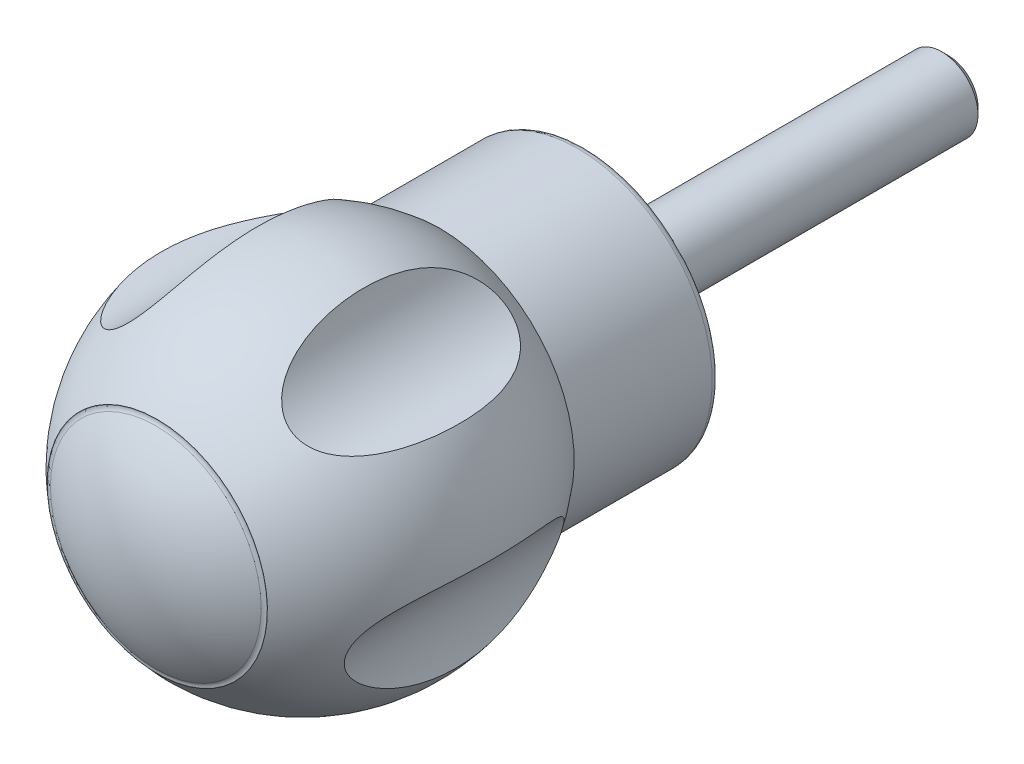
ISO-10303-21;
HEADER;
FILE_DESCRIPTION(('STEP AP214'),'2;1');
FILE_NAME('part.step','',(''),(''),'','','');
FILE_SCHEMA(('AUTOMOTIVE_DESIGN { 1 0 10303 214 1 1 1 1 }'));
ENDSEC;
DATA;
#1=APPLICATION_CONTEXT('core data for automotive mechanical design processes');
#2=APPLICATION_PROTOCOL_DEFINITION('international standard','automotive_design',2000,#1);
#3=PRODUCT_CONTEXT('',#1,'mechanical');
#4=PRODUCT('Part','Part','',(#3));
#5=PRODUCT_RELATED_PRODUCT_CATEGORY('part','',(#4));
#6=PRODUCT_DEFINITION_FORMATION('','',#4);
#7=PRODUCT_DEFINITION_CONTEXT('part definition',#1,'design');
#8=PRODUCT_DEFINITION('design','',#6,#7);
#9=PRODUCT_DEFINITION_SHAPE('','',#8);
#10=(LENGTH_UNIT() NAMED_UNIT(*) SI_UNIT(.MILLI.,.METRE.));
#11=(NAMED_UNIT(*) PLANE_ANGLE_UNIT() SI_UNIT($,.RADIAN.));
#12=(NAMED_UNIT(*) SI_UNIT($,.STERADIAN.) SOLID_ANGLE_UNIT());
#13=UNCERTAINTY_MEASURE_WITH_UNIT(LENGTH_MEASURE(1.E-05),#10,'distance_accuracy_value','');
#14=(GEOMETRIC_REPRESENTATION_CONTEXT(3) GLOBAL_UNCERTAINTY_ASSIGNED_CONTEXT((#13)) GLOBAL_UNIT_ASSIGNED_CONTEXT((#10,
#11,#12)) REPRESENTATION_CONTEXT('',''));
#15=CARTESIAN_POINT('',(0.,0.,0.));
#16=DIRECTION('',(0.,0.,1.));
#17=DIRECTION('',(1.,0.,0.));
#18=AXIS2_PLACEMENT_3D('',#15,#16,#17);
#19=CARTESIAN_POINT('',(0.,0.,0.));
#20=DIRECTION('',(0.,0.,-1.));
#21=DIRECTION('',(0.,1.,0.));
#22=AXIS2_PLACEMENT_3D('',#19,#20,#21);
#23=PLANE('',#22);
#24=CARTESIAN_POINT('',(0.,0.,0.));
#25=DIRECTION('',(0.,0.,-1.));
#26=DIRECTION('',(0.,1.,0.));
#27=AXIS2_PLACEMENT_3D('',#24,#25,#26);
#28=CIRCLE('',#27,5.);
#29=CARTESIAN_POINT('',(0.,5.,0.));
#30=VERTEX_POINT('',#29);
#31=EDGE_CURVE('E8',#30,#30,#28,.T.);
#32=ORIENTED_EDGE('',*,*,#31,.F.);
#33=EDGE_LOOP('',(#32));
#34=FACE_BOUND('',#33,.T.);
#35=CARTESIAN_POINT('',(0.,0.,0.));
#36=DIRECTION('',(0.,0.,-1.));
#37=DIRECTION('',(0.,1.,0.));
#38=AXIS2_PLACEMENT_3D('',#35,#36,#37);
#39=CIRCLE('',#38,17.5);
#40=CARTESIAN_POINT('',(0.,17.5,0.));
#41=VERTEX_POINT('',#40);
#42=EDGE_CURVE('E18',#41,#41,#39,.T.);
#43=ORIENTED_EDGE('',*,*,#42,.T.);
#44=EDGE_LOOP('',(#43));
#45=FACE_BOUND('',#44,.T.);
#46=ADVANCED_FACE('F12',(#34,#45),#23,.T.);
#47=CARTESIAN_POINT('',(0.,0.,0.999999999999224));
#48=DIRECTION('',(0.,0.,-1.));
#49=DIRECTION('',(0.,1.,0.));
#50=AXIS2_PLACEMENT_3D('',#47,#48,#49);
#51=TOROIDAL_SURFACE('',#50,17.5000000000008,0.999999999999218);
#52=CARTESIAN_POINT('',(0.,0.,1.));
#53=DIRECTION('',(0.,0.,-1.));
#54=DIRECTION('',(0.,1.,0.));
#55=AXIS2_PLACEMENT_3D('',#52,#53,#54);
#56=CIRCLE('',#55,18.5);
#57=CARTESIAN_POINT('',(0.,18.5,1.));
#58=VERTEX_POINT('',#57);
#59=EDGE_CURVE('E22',#58,#58,#56,.T.);
#60=ORIENTED_EDGE('',*,*,#59,.T.);
#61=EDGE_LOOP('',(#60));
#62=FACE_BOUND('',#61,.T.);
#63=ORIENTED_EDGE('',*,*,#42,.F.);
#64=EDGE_LOOP('',(#63));
#65=FACE_BOUND('',#64,.T.);
#66=ADVANCED_FACE('F120',(#62,#65),#51,.T.);
#67=CARTESIAN_POINT('',(0.,0.,64.));
#68=DIRECTION('',(0.,0.,-1.));
#69=DIRECTION('',(0.,1.,0.));
#70=AXIS2_PLACEMENT_3D('',#67,#68,#69);
#71=CYLINDRICAL_SURFACE('',#70,18.5);
#72=CARTESIAN_POINT('',(0.,0.,20.));
#73=DIRECTION('',(0.,0.,-1.));
#74=DIRECTION('',(0.,1.,0.));
#75=AXIS2_PLACEMENT_3D('',#72,#73,#74);
#76=CIRCLE('',#75,18.5);
#77=CARTESIAN_POINT('',(0.,18.5,20.));
#78=VERTEX_POINT('',#77);
#79=EDGE_CURVE('E27',#78,#78,#76,.T.);
#80=ORIENTED_EDGE('',*,*,#79,.T.);
#81=EDGE_LOOP('',(#80));
#82=FACE_BOUND('',#81,.T.);
#83=ORIENTED_EDGE('',*,*,#59,.F.);
#84=EDGE_LOOP('',(#83));
#85=FACE_BOUND('',#84,.T.);
#86=ADVANCED_FACE('F106',(#82,#85),#71,.T.);
#87=CARTESIAN_POINT('',(0.,0.,37.7823040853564));
#88=DIRECTION('',(0.,0.,-1.));
#89=DIRECTION('',(0.,1.,0.));
#90=AXIS2_PLACEMENT_3D('',#87,#88,#89);
#91=DEGENERATE_TOROIDAL_SURFACE('',#90,2.45981194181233,27.4867978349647,.F.);
#92=CARTESIAN_POINT('',(9.64615552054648,19.1331819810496,24.1833184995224));
#93=CARTESIAN_POINT('',(9.48345657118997,19.3402419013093,24.3794324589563));
#94=CARTESIAN_POINT('',(9.3348650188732,19.5426746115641,24.5920665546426));
#95=CARTESIAN_POINT('',(9.06234425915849,19.9357170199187,25.0428562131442));
#96=CARTESIAN_POINT('',(8.93845436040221,20.1263075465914,25.2810515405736));
#97=CARTESIAN_POINT('',(8.71118421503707,20.4952338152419,25.7786146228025));
#98=CARTESIAN_POINT('',(8.60794571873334,20.6734797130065,26.0381125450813));
#99=CARTESIAN_POINT('',(8.41968766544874,21.0155888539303,26.5724184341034));
#100=CARTESIAN_POINT('',(8.33466135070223,21.1794574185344,26.8472206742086));
#101=CARTESIAN_POINT('',(8.14928092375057,21.5544472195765,27.5198032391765));
#102=CARTESIAN_POINT('',(8.05609382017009,21.7587365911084,27.9233650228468));
#103=CARTESIAN_POINT('',(7.89274210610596,22.1392008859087,28.7480367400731));
#104=CARTESIAN_POINT('',(7.8225900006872,22.3153605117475,29.1691560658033));
#105=CARTESIAN_POINT('',(7.70040655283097,22.6396177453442,30.023843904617));
#106=CARTESIAN_POINT('',(7.64835011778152,22.787754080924,30.4573942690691));
#107=CARTESIAN_POINT('',(7.5583515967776,23.0566849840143,31.3342431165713));
#108=CARTESIAN_POINT('',(7.52040841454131,23.1774816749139,31.7775408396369));
#109=CARTESIAN_POINT('',(7.46554169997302,23.359526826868,32.5355594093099));
#110=CARTESIAN_POINT('',(7.44573424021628,23.4277178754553,32.8484350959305));
#111=CARTESIAN_POINT('',(7.41078752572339,23.5511669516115,33.4770140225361));
#112=CARTESIAN_POINT('',(7.39564860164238,23.6064240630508,33.7927174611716));
#113=CARTESIAN_POINT('',(7.36943118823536,23.7041033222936,34.4263549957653));
#114=CARTESIAN_POINT('',(7.35835379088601,23.7465220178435,34.744289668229));
#115=CARTESIAN_POINT('',(7.33982062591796,23.8185798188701,35.3817210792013));
#116=CARTESIAN_POINT('',(7.3323652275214,23.8482176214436,35.7012179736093));
#117=CARTESIAN_POINT('',(7.31489793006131,23.9181580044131,36.662895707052));
#118=CARTESIAN_POINT('',(7.30984724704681,23.9392423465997,37.3066647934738));
#119=CARTESIAN_POINT('',(7.31201499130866,23.930357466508,38.5937099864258));
#120=CARTESIAN_POINT('',(7.3192310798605,23.9003979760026,39.2369861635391));
#121=CARTESIAN_POINT('',(7.34031673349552,23.8167327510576,40.2018959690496));
#122=CARTESIAN_POINT('',(7.34913632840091,23.7820772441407,40.5253890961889));
#123=CARTESIAN_POINT('',(7.37065082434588,23.6995982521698,41.1705501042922));
#124=CARTESIAN_POINT('',(7.38334530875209,23.6517761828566,41.4922181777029));
#125=CARTESIAN_POINT('',(7.41313830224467,23.5428498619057,42.1332804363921));
#126=CARTESIAN_POINT('',(7.4302392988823,23.4817381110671,42.4526732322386));
#127=CARTESIAN_POINT('',(7.46953672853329,23.346142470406,43.0882937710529));
#128=CARTESIAN_POINT('',(7.49173305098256,23.2716588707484,43.4045215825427));
#129=CARTESIAN_POINT('',(7.54196498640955,23.1096128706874,44.0313942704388));
#130=CARTESIAN_POINT('',(7.56996980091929,23.0221201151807,44.3420595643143));
#131=CARTESIAN_POINT('',(7.63295092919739,22.8336259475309,44.9585946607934));
#132=CARTESIAN_POINT('',(7.66792784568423,22.7326233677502,45.2644640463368));
#133=CARTESIAN_POINT('',(7.74609493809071,22.5170918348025,45.8699523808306));
#134=CARTESIAN_POINT('',(7.78927572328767,22.4025784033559,46.1695780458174));
#135=CARTESIAN_POINT('',(7.88540878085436,22.1598219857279,46.7615525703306));
#136=CARTESIAN_POINT('',(7.93835812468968,22.0315831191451,47.0539035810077));
#137=CARTESIAN_POINT('',(8.04334062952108,21.7901126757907,47.568273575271));
#138=CARTESIAN_POINT('',(8.09315689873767,21.6795205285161,47.7919850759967));
#139=CARTESIAN_POINT('',(8.2010375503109,21.4497580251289,48.2329104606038));
#140=CARTESIAN_POINT('',(8.25910080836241,21.3305888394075,48.4501252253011));
#141=CARTESIAN_POINT('',(8.3847913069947,21.0834789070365,48.8772303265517));
#142=CARTESIAN_POINT('',(8.45243513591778,20.9555231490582,49.0871071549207));
#143=CARTESIAN_POINT('',(8.59858161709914,20.6911498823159,49.4975980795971));
#144=CARTESIAN_POINT('',(8.67708445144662,20.5547322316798,49.6982120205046));
#145=CARTESIAN_POINT('',(8.84769419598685,20.2716944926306,50.0910311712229));
#146=CARTESIAN_POINT('',(8.93998001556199,20.1249561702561,50.283074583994));
#147=CARTESIAN_POINT('',(9.13905119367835,19.8235620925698,50.6531080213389));
#148=CARTESIAN_POINT('',(9.24584025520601,19.6689043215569,50.831094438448));
#149=CARTESIAN_POINT('',(9.47526528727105,19.3532201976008,51.1690858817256));
#150=CARTESIAN_POINT('',(9.5978411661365,19.1922195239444,51.3291549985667));
#151=CARTESIAN_POINT('',(9.86055062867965,18.8650643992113,51.6279005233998));
#152=CARTESIAN_POINT('',(10.0006666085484,18.698915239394,51.7665980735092));
#153=CARTESIAN_POINT('',(10.3189452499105,18.3420469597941,52.034220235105));
#154=CARTESIAN_POINT('',(10.4996818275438,18.1509018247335,52.1596296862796));
#155=CARTESIAN_POINT('',(10.7882432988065,17.8653559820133,52.3173260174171));
#156=CARTESIAN_POINT('',(10.8873535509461,17.7703573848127,52.3648259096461));
#157=CARTESIAN_POINT('',(11.0911138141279,17.5814933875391,52.4488653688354));
#158=CARTESIAN_POINT('',(11.1957612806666,17.4876274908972,52.4854099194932));
#159=CARTESIAN_POINT('',(11.4109272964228,17.3011546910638,52.547029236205));
#160=CARTESIAN_POINT('',(11.5214842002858,17.2085626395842,52.5720153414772));
#161=CARTESIAN_POINT('',(11.7469624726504,17.0262974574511,52.6095383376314));
#162=CARTESIAN_POINT('',(11.8618819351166,16.9366230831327,52.6220806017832));
#163=CARTESIAN_POINT('',(12.0952129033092,16.7610112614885,52.6344332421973));
#164=CARTESIAN_POINT('',(12.213624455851,16.675073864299,52.6342434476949));
#165=CARTESIAN_POINT('',(12.4528872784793,16.5076976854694,52.6211364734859));
#166=CARTESIAN_POINT('',(12.5737384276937,16.4262586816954,52.6082199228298));
#167=CARTESIAN_POINT('',(12.8055938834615,16.2757414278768,52.5717303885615));
#168=CARTESIAN_POINT('',(12.9164810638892,16.2062153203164,52.5492472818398));
#169=CARTESIAN_POINT('',(13.1385793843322,16.0716588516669,52.4944712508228));
#170=CARTESIAN_POINT('',(13.2497906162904,16.0066299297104,52.4621752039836));
#171=CARTESIAN_POINT('',(13.5827295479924,15.8186232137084,52.3513785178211));
#172=CARTESIAN_POINT('',(13.8038861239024,15.7026457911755,52.2589490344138));
#173=CARTESIAN_POINT('',(14.320248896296,15.450110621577,52.0022092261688));
#174=CARTESIAN_POINT('',(14.6125049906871,15.3218679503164,51.8239538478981));
#175=CARTESIAN_POINT('',(15.1772253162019,15.0968616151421,51.4218619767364));
#176=CARTESIAN_POINT('',(15.4496457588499,15.0001660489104,51.1979285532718));
#177=CARTESIAN_POINT('',(15.9069492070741,14.8535028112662,50.7756127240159));
#178=CARTESIAN_POINT('',(16.0968863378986,14.7978916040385,50.5844859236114));
#179=CARTESIAN_POINT('',(16.4633333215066,14.699129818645,50.1866432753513));
#180=CARTESIAN_POINT('',(16.6398361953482,14.6559856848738,49.9799194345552));
#181=CARTESIAN_POINT('',(16.9795964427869,14.5800076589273,49.5536597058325));
#182=CARTESIAN_POINT('',(17.1428342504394,14.5471887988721,49.3341056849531));
#183=CARTESIAN_POINT('',(17.4561371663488,14.4900636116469,48.8846930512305));
#184=CARTESIAN_POINT('',(17.6061977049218,14.465760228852,48.6548309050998));
#185=CARTESIAN_POINT('',(17.9868742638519,14.4104834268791,48.0345307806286));
#186=CARTESIAN_POINT('',(18.2064910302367,14.3854339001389,47.6367866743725));
#187=CARTESIAN_POINT('',(18.6128643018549,14.3481661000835,46.824233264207));
#188=CARTESIAN_POINT('',(18.7996003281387,14.3359557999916,46.4094135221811));
#189=CARTESIAN_POINT('',(19.1421520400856,14.3198933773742,45.5664949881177));
#190=CARTESIAN_POINT('',(19.2979273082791,14.3160521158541,45.1383796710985));
#191=CARTESIAN_POINT('',(19.5797908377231,14.3133116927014,44.2725635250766));
#192=CARTESIAN_POINT('',(19.7058818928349,14.3144120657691,43.8348636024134));
#193=CARTESIAN_POINT('',(19.8965253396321,14.3182934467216,43.0829226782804));
#194=CARTESIAN_POINT('',(19.9682474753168,14.3204809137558,42.7704677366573));
#195=CARTESIAN_POINT('',(20.0979520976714,14.3253342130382,42.1426951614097));
#196=CARTESIAN_POINT('',(20.1559336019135,14.3280000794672,41.8273773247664));
#197=CARTESIAN_POINT('',(20.2584423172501,14.3332555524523,41.1944730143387));
#198=CARTESIAN_POINT('',(20.3029657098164,14.3358451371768,40.8768859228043));
#199=CARTESIAN_POINT('',(20.3787485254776,14.3405408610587,40.2401174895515));
#200=CARTESIAN_POINT('',(20.4100065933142,14.3426469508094,39.9209359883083));
#201=CARTESIAN_POINT('',(20.4842130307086,14.3477811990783,38.9605812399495));
#202=CARTESIAN_POINT('',(20.5074047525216,14.3496131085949,38.3177751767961));
#203=CARTESIAN_POINT('',(20.5015908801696,14.3491769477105,37.0325236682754));
#204=CARTESIAN_POINT('',(20.4725953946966,14.3469096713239,36.3900781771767));
#205=CARTESIAN_POINT('',(20.3892363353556,14.3412565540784,35.4261568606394));
#206=CARTESIAN_POINT('',(20.3544771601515,14.33897637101,35.1028822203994));
#207=CARTESIAN_POINT('',(20.2712780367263,14.3340068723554,34.4581139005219));
#208=CARTESIAN_POINT('',(20.2228395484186,14.331317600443,34.1366200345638));
#209=CARTESIAN_POINT('',(20.1120162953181,14.3259866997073,33.4958601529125));
#210=CARTESIAN_POINT('',(20.0496237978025,14.3233450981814,33.1765954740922));
#211=CARTESIAN_POINT('',(19.9105983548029,14.3187268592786,32.5411744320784));
#212=CARTESIAN_POINT('',(19.8339657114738,14.3167502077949,32.2250180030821));
#213=CARTESIAN_POINT('',(19.6664947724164,14.3142459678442,31.59816542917));
#214=CARTESIAN_POINT('',(19.5757293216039,14.3137111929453,31.2874499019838));
#215=CARTESIAN_POINT('',(19.3792557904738,14.3150195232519,30.6707388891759));
#216=CARTESIAN_POINT('',(19.2735464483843,14.3168628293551,30.364743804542));
#217=CARTESIAN_POINT('',(19.0467867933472,14.3240841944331,29.7589039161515));
#218=CARTESIAN_POINT('',(18.9257536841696,14.3294583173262,29.4590526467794));
#219=CARTESIAN_POINT('',(18.667680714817,14.3451379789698,28.866510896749));
#220=CARTESIAN_POINT('',(18.5306455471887,14.3554420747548,28.5738183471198));
#221=CARTESIAN_POINT('',(18.2698206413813,14.3798794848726,28.0565192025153));
#222=CARTESIAN_POINT('',(18.1491118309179,14.3927877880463,27.8303006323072));
#223=CARTESIAN_POINT('',(17.8968255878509,14.4237999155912,27.3843837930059));
#224=CARTESIAN_POINT('',(17.7652496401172,14.4419030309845,27.1646846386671));
#225=CARTESIAN_POINT('',(17.4906228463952,14.4845139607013,26.7326331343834));
#226=CARTESIAN_POINT('',(17.3475519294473,14.5090331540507,26.5202946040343));
#227=CARTESIAN_POINT('',(17.0498212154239,14.5658261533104,26.1049313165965));
#228=CARTESIAN_POINT('',(16.8951612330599,14.5981000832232,25.9019067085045));
#229=CARTESIAN_POINT('',(16.5716975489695,14.6725075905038,25.5042749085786));
#230=CARTESIAN_POINT('',(16.4027212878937,14.7147773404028,25.3098324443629));
#231=CARTESIAN_POINT('',(16.0525323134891,14.8107759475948,24.9351177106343));
#232=CARTESIAN_POINT('',(15.8713163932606,14.8645078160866,24.7548491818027));
#233=CARTESIAN_POINT('',(15.4977153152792,14.9852344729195,24.4124922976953));
#234=CARTESIAN_POINT('',(15.3053750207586,15.0521783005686,24.2503377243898));
#235=CARTESIAN_POINT('',(14.9101396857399,15.2013886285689,23.9476798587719));
#236=CARTESIAN_POINT('',(14.7072556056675,15.2836394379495,23.8071546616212));
#237=CARTESIAN_POINT('',(14.2677894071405,15.4762585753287,23.5371657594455));
#238=CARTESIAN_POINT('',(14.0300690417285,15.5888074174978,23.4110046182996));
#239=CARTESIAN_POINT('',(13.6691228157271,15.7746252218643,23.2521491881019));
#240=CARTESIAN_POINT('',(13.5480644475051,15.839406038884,23.204257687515));
#241=CARTESIAN_POINT('',(13.3052834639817,15.9746013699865,23.1194301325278));
#242=CARTESIAN_POINT('',(13.1835611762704,16.0450133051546,23.0824890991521));
#243=CARTESIAN_POINT('',(12.9394612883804,16.1918335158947,23.0200747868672));
#244=CARTESIAN_POINT('',(12.8170857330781,16.2682832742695,22.9946907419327));
#245=CARTESIAN_POINT('',(12.5737336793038,16.4262595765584,22.9563831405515));
#246=CARTESIAN_POINT('',(12.4527565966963,16.5077839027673,22.9434541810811));
#247=CARTESIAN_POINT('',(12.2132400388,16.6753479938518,22.9303540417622));
#248=CARTESIAN_POINT('',(12.0947006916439,16.761387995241,22.9301835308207));
#249=CARTESIAN_POINT('',(11.8611503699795,16.937182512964,22.9425849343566));
#250=CARTESIAN_POINT('',(11.7461391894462,17.026936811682,22.955156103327));
#251=CARTESIAN_POINT('',(11.4286566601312,17.2836473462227,23.0081332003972));
#252=CARTESIAN_POINT('',(11.2311540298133,17.4540059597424,23.0628637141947));
#253=CARTESIAN_POINT('',(10.8547688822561,17.798819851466,23.2095558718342));
#254=CARTESIAN_POINT('',(10.6758911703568,17.9732761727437,23.3015270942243));
#255=CARTESIAN_POINT('',(10.3454340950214,18.3141897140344,23.5125503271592));
#256=CARTESIAN_POINT('',(10.1930118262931,18.4806684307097,23.6302683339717));
#257=CARTESIAN_POINT('',(9.9063000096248,18.8100812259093,23.8898050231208));
#258=CARTESIAN_POINT('',(9.77200724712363,18.9730159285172,24.0316194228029));
#259=CARTESIAN_POINT('',(9.64615552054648,19.1331819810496,24.1833184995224));
#260=B_SPLINE_CURVE_WITH_KNOTS('',3,(#92,#93,#94,#95,#96,#97,#98,#99,#100,#101,#102,#103,#104,
#105,#106,#107,#108,#109,#110,#111,#112,#113,#114,#115,#116,#117,#118,#119,#120,#121,#122,#123,
#124,#125,#126,#127,#128,#129,#130,#131,#132,#133,#134,#135,#136,#137,#138,#139,#140,#141,#142,
#143,#144,#145,#146,#147,#148,#149,#150,#151,#152,#153,#154,#155,#156,#157,#158,#159,#160,#161,
#162,#163,#164,#165,#166,#167,#168,#169,#170,#171,#172,#173,#174,#175,#176,#177,#178,#179,#180,
#181,#182,#183,#184,#185,#186,#187,#188,#189,#190,#191,#192,#193,#194,#195,#196,#197,#198,#199,
#200,#201,#202,#203,#204,#205,#206,#207,#208,#209,#210,#211,#212,#213,#214,#215,#216,#217,#218,
#219,#220,#221,#222,#223,#224,#225,#226,#227,#228,#229,#230,#231,#232,#233,#234,#235,#236,#237,
#238,#239,#240,#241,#242,#243,#244,#245,#246,#247,#248,#249,#250,#251,#252,#253,#254,#255,#256,
#257,#258,#259),.UNSPECIFIED.,.T.,.F.,(4,2,2,2,2,2,2,2,2,2,2,2,2,2,2,2,2,2,2,2,2,2,2,2,2,2,2,2,
2,2,2,2,2,2,2,2,2,2,2,2,2,2,2,2,2,2,2,2,2,2,2,2,2,2,2,2,2,2,2,2,2,2,2,2,2,2,2,2,2,2,2,2,2,2,2,2,
2,2,2,2,2,2,2,4),(0.,0.984470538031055,1.97049541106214,2.96307211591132,3.95527987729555,
5.33855218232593,6.72257419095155,8.10466929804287,9.4866570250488,10.4488665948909,
11.4111442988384,12.3736805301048,13.3363148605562,15.2664246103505,17.1961664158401,
18.1723123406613,19.1483533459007,20.1249465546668,21.1015185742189,22.07303913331,
23.0446437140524,24.0151427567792,24.9853513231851,25.7484674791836,26.5114796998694,
27.2758295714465,28.0401922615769,28.8155138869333,29.5910338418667,30.3636845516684,
31.1355659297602,32.0061083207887,32.4414898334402,32.8766729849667,33.3151410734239,
33.7534197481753,34.1917043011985,34.6299671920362,35.0279045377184,35.4259686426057,
36.2216565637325,37.3123882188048,38.4054589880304,39.22976871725,40.0545037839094,
40.8804340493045,41.7066496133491,43.0696147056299,44.4334257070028,45.7990055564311,
47.1644568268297,48.1259320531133,49.0874760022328,50.0492925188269,51.0112072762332,
52.9386033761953,54.8656261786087,55.8408202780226,56.815910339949,57.7915421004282,
58.7671531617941,59.7378926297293,60.7087141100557,61.678455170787,62.6479125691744,
63.417790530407,64.1875634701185,64.9587109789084,65.7298708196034,66.5122118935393,
67.2947587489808,68.0743441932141,68.8531348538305,69.7245362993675,70.1603455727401,
70.5959563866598,71.0348758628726,71.4736048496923,71.9123568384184,72.3510831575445,
73.1467362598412,73.9425941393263,74.7042420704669,75.4657547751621),.UNSPECIFIED.);
#261=CARTESIAN_POINT('',(9.64615552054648,19.1331819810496,24.1833184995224));
#262=VERTEX_POINT('',#261);
#263=EDGE_CURVE('E83',#262,#262,#260,.T.);
#264=ORIENTED_EDGE('',*,*,#263,.F.);
#265=EDGE_LOOP('',(#264));
#266=FACE_BOUND('',#265,.T.);
#267=CARTESIAN_POINT('',(19.0721852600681,-11.1680952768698,25.4426161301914));
#268=CARTESIAN_POINT('',(19.0623640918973,-11.0283355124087,25.2851801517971));
#269=CARTESIAN_POINT('',(19.0545384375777,-10.8837357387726,25.1318868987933));
#270=CARTESIAN_POINT('',(19.0438547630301,-10.5846503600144,24.8351316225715));
#271=CARTESIAN_POINT('',(19.0409972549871,-10.4301637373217,24.691670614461));
#272=CARTESIAN_POINT('',(19.0415090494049,-9.95209015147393,24.2791378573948));
#273=CARTESIAN_POINT('',(19.0538954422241,-9.61310588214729,24.0270115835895));
#274=CARTESIAN_POINT('',(19.1041865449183,-8.99900634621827,23.6497700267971));
#275=CARTESIAN_POINT('',(19.1338737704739,-8.73297996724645,23.5089050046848));
#276=CARTESIAN_POINT('',(19.1938752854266,-8.32262867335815,23.3287295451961));
#277=CARTESIAN_POINT('',(19.2164603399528,-8.18393056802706,23.2738501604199));
#278=CARTESIAN_POINT('',(19.267080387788,-7.90355872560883,23.1754616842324));
#279=CARTESIAN_POINT('',(19.2951129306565,-7.76188635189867,23.1319475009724));
#280=CARTESIAN_POINT('',(19.357082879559,-7.47527231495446,23.0568566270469));
#281=CARTESIAN_POINT('',(19.3910701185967,-7.33031284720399,23.0253884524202));
#282=CARTESIAN_POINT('',(19.4647864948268,-7.03957276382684,22.9756795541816));
#283=CARTESIAN_POINT('',(19.5045155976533,-6.89379215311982,22.9574387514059));
#284=CARTESIAN_POINT('',(19.5895057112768,-6.60284514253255,22.9346551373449));
#285=CARTESIAN_POINT('',(19.6347640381,-6.45767847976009,22.9301057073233));
#286=CARTESIAN_POINT('',(19.7304375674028,-6.16929121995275,22.9348062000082));
#287=CARTESIAN_POINT('',(19.780852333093,-6.02607045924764,22.9440549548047));
#288=CARTESIAN_POINT('',(19.8798541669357,-5.76014382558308,22.9741532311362));
#289=CARTESIAN_POINT('',(19.9279160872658,-5.63706374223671,22.9934527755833));
#290=CARTESIAN_POINT('',(20.0271323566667,-5.39416709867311,23.0421227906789));
#291=CARTESIAN_POINT('',(20.0782876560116,-5.27435155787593,23.0714963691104));
#292=CARTESIAN_POINT('',(20.2356369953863,-4.92085237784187,23.1739727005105));
#293=CARTESIAN_POINT('',(20.3457684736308,-4.6929725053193,23.2614481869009));
#294=CARTESIAN_POINT('',(20.6101862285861,-4.18352994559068,23.5040625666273));
#295=CARTESIAN_POINT('',(20.7669386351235,-3.90944430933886,23.6720412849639));
#296=CARTESIAN_POINT('',(21.0837421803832,-3.39692062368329,24.0533196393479));
#297=CARTESIAN_POINT('',(21.2437993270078,-3.15855548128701,24.266709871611));
#298=CARTESIAN_POINT('',(21.5210545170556,-2.77180192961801,24.6689738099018));
#299=CARTESIAN_POINT('',(21.6388543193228,-2.61590410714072,24.8503989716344));
#300=CARTESIAN_POINT('',(21.8714595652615,-2.32137372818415,25.2286598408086));
#301=CARTESIAN_POINT('',(21.9862634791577,-2.18274986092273,25.4255032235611));
#302=CARTESIAN_POINT('',(22.2117703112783,-1.92107852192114,25.8319054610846));
#303=CARTESIAN_POINT('',(22.3224670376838,-1.79805394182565,26.0414823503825));
#304=CARTESIAN_POINT('',(22.538766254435,-1.5662031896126,26.4709068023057));
#305=CARTESIAN_POINT('',(22.6443669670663,-1.45738195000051,26.6907578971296));
#306=CARTESIAN_POINT('',(22.9164150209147,-1.18608106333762,27.2841896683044));
#307=CARTESIAN_POINT('',(23.0779389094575,-1.03453662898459,27.6650536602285));
#308=CARTESIAN_POINT('',(23.3834716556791,-0.76045920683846,28.4439005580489));
#309=CARTESIAN_POINT('',(23.5274695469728,-0.637944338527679,28.8418939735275));
#310=CARTESIAN_POINT('',(23.7968925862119,-0.417328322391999,29.6513113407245));
#311=CARTESIAN_POINT('',(23.9222912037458,-0.31926191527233,30.0627534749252));
#312=CARTESIAN_POINT('',(24.1534746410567,-0.144173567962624,30.8954130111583));
#313=CARTESIAN_POINT('',(24.2592612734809,-0.0671496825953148,31.3166295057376));
#314=CARTESIAN_POINT('',(24.4238467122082,0.0496019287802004,32.047227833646));
#315=CARTESIAN_POINT('',(24.4875023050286,0.0937309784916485,32.3548380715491));
#316=CARTESIAN_POINT('',(24.6042630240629,0.173368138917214,32.973190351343));
#317=CARTESIAN_POINT('',(24.6573673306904,0.208875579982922,33.2839326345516));
#318=CARTESIAN_POINT('',(24.7529207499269,0.271939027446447,33.9079408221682));
#319=CARTESIAN_POINT('',(24.7953666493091,0.29949263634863,34.2212074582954));
#320=CARTESIAN_POINT('',(24.8695059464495,0.347151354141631,34.849603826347));
#321=CARTESIAN_POINT('',(24.9011982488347,0.367255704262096,35.1647337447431));
#322=CARTESIAN_POINT('',(24.9538094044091,0.4004149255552,35.7967783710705));
#323=CARTESIAN_POINT('',(24.9747105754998,0.41345822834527,36.1136951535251));
#324=CARTESIAN_POINT('',(25.0056258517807,0.432690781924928,36.7482953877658));
#325=CARTESIAN_POINT('',(25.0156389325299,0.438879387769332,37.0659789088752));
#326=CARTESIAN_POINT('',(25.0247561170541,0.444515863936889,37.701486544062));
#327=CARTESIAN_POINT('',(25.0238628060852,0.443965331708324,38.0193106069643));
#328=CARTESIAN_POINT('',(25.0111750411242,0.436117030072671,38.6546576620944));
#329=CARTESIAN_POINT('',(24.9993805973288,0.4288192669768,38.9721806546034));
#330=CARTESIAN_POINT('',(24.9646664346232,0.407187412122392,39.6109021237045));
#331=CARTESIAN_POINT('',(24.9415913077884,0.392754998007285,39.9320888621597));
#332=CARTESIAN_POINT('',(24.8842948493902,0.35653347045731,40.5730139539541));
#333=CARTESIAN_POINT('',(24.8500748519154,0.334745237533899,40.8927524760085));
#334=CARTESIAN_POINT('',(24.770531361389,0.28337778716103,41.5303953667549));
#335=CARTESIAN_POINT('',(24.7252019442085,0.253794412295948,41.8482986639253));
#336=CARTESIAN_POINT('',(24.6235459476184,0.186275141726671,42.4814152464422));
#337=CARTESIAN_POINT('',(24.5672207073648,0.148340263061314,42.7966288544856));
#338=CARTESIAN_POINT('',(24.4439137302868,0.0635358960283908,43.4225619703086));
#339=CARTESIAN_POINT('',(24.3769710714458,0.0166990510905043,43.7332935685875));
#340=CARTESIAN_POINT('',(24.2324546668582,-0.0868896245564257,44.3505654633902));
#341=CARTESIAN_POINT('',(24.154882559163,-0.143639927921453,44.657106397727));
#342=CARTESIAN_POINT('',(23.9893767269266,-0.268104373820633,45.264857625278));
#343=CARTESIAN_POINT('',(23.9014515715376,-0.335809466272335,45.5660720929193));
#344=CARTESIAN_POINT('',(23.7154832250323,-0.483512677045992,46.1622480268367));
#345=CARTESIAN_POINT('',(23.6174424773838,-0.563507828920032,46.45721098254));
#346=CARTESIAN_POINT('',(23.4257259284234,-0.725434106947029,46.9996108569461));
#347=CARTESIAN_POINT('',(23.3332965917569,-0.80559397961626,47.248016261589));
#348=CARTESIAN_POINT('',(23.1414992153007,-0.977402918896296,47.738084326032));
#349=CARTESIAN_POINT('',(23.042131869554,-1.0690508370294,47.9797476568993));
#350=CARTESIAN_POINT('',(22.836865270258,-1.2651914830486,48.4550245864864));
#351=CARTESIAN_POINT('',(22.7309652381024,-1.36968574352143,48.6886372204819));
#352=CARTESIAN_POINT('',(22.5132257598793,-1.5930227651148,49.1460594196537));
#353=CARTESIAN_POINT('',(22.4013870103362,-1.71186384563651,49.3698701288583));
#354=CARTESIAN_POINT('',(22.1901963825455,-1.94603320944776,49.771941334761));
#355=CARTESIAN_POINT('',(22.0915743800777,-2.05908329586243,49.9519081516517));
#356=CARTESIAN_POINT('',(21.8912959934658,-2.29775849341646,50.3016081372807));
#357=CARTESIAN_POINT('',(21.7896393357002,-2.42338474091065,50.4713403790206));
#358=CARTESIAN_POINT('',(21.5843567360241,-2.68806499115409,50.7981776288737));
#359=CARTESIAN_POINT('',(21.4807348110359,-2.82709356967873,50.9553055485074));
#360=CARTESIAN_POINT('',(21.2725598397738,-3.11965882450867,51.2546655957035));
#361=CARTESIAN_POINT('',(21.1680069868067,-3.27319254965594,51.3969007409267));
#362=CARTESIAN_POINT('',(20.9242857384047,-3.64993770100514,51.7083703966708));
#363=CARTESIAN_POINT('',(20.7852831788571,-3.87923401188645,51.8706322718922));
#364=CARTESIAN_POINT('',(20.581320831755,-4.24337798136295,52.08338385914));
#365=CARTESIAN_POINT('',(20.5140777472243,-4.36815194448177,52.1492039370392));
#366=CARTESIAN_POINT('',(20.3818256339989,-4.62414700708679,52.2695153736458));
#367=CARTESIAN_POINT('',(20.3168154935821,-4.75536481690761,52.3240124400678));
#368=CARTESIAN_POINT('',(20.1891131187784,-5.02518084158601,52.4211148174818));
#369=CARTESIAN_POINT('',(20.1264539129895,-5.1638439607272,52.4635838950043));
#370=CARTESIAN_POINT('',(20.0050835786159,-5.44625718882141,52.5348095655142));
#371=CARTESIAN_POINT('',(19.9463703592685,-5.5900045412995,52.5635734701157));
#372=CARTESIAN_POINT('',(19.8336837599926,-5.88139098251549,52.6066569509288));
#373=CARTESIAN_POINT('',(19.779707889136,-6.02902797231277,52.6209841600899));
#374=CARTESIAN_POINT('',(19.6771442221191,-6.32683662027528,52.6348208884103));
#375=CARTESIAN_POINT('',(19.6285557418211,-6.47700795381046,52.6343322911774));
#376=CARTESIAN_POINT('',(19.5436532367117,-6.75723229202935,52.6196633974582));
#377=CARTESIAN_POINT('',(19.5065731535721,-6.88715799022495,52.607409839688));
#378=CARTESIAN_POINT('',(19.4369248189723,-7.14678746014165,52.5722284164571));
#379=CARTESIAN_POINT('',(19.4043578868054,-7.27649115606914,52.5492974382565));
#380=CARTESIAN_POINT('',(19.3135579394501,-7.66382691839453,52.4651006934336));
#381=CARTESIAN_POINT('',(19.2621768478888,-7.91984661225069,52.3884218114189));
#382=CARTESIAN_POINT('',(19.1660350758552,-8.48522658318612,52.1749375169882));
#383=CARTESIAN_POINT('',(19.1263358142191,-8.79146523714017,52.027765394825));
#384=CARTESIAN_POINT('',(19.0700867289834,-9.38041135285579,51.6886082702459));
#385=CARTESIAN_POINT('',(19.0535777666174,-9.66307645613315,51.4965448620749));
#386=CARTESIAN_POINT('',(19.0405665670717,-10.1295722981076,51.1346277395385));
#387=CARTESIAN_POINT('',(19.0398828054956,-10.3195626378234,50.9726561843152));
#388=CARTESIAN_POINT('',(19.0462252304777,-10.6856064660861,50.6336861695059));
#389=CARTESIAN_POINT('',(19.0532550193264,-10.8616534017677,50.4566807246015));
#390=CARTESIAN_POINT('',(19.0733427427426,-11.2002791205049,50.0901686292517));
#391=CARTESIAN_POINT('',(19.0864092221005,-11.3628384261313,49.9006445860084));
#392=CARTESIAN_POINT('',(19.117108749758,-11.6748367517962,49.5114023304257));
#393=CARTESIAN_POINT('',(19.1347433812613,-11.8242711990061,49.3116806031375));
#394=CARTESIAN_POINT('',(19.1856441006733,-12.202226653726,48.7733353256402));
#395=CARTESIAN_POINT('',(19.2216949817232,-12.4202162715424,48.4275565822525));
#396=CARTESIAN_POINT('',(19.2981940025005,-12.825499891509,47.7188879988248));
#397=CARTESIAN_POINT('',(19.3386448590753,-13.0127747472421,47.3559876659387));
#398=CARTESIAN_POINT('',(19.4206221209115,-13.35943497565,46.6165314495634));
#399=CARTESIAN_POINT('',(19.4621502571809,-13.5187718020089,46.2399531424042));
#400=CARTESIAN_POINT('',(19.5435868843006,-13.8113796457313,45.4767269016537));
#401=CARTESIAN_POINT('',(19.5834955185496,-13.9446529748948,45.0900798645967));
#402=CARTESIAN_POINT('',(19.6501579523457,-14.1566882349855,44.4066290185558));
#403=CARTESIAN_POINT('',(19.6777064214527,-14.2407488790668,44.1115260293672));
#404=CARTESIAN_POINT('',(19.7300953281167,-14.3958988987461,43.5176637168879));
#405=CARTESIAN_POINT('',(19.7549355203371,-14.4669870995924,43.2189040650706));
#406=CARTESIAN_POINT('',(19.8013565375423,-14.5967402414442,42.6183481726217));
#407=CARTESIAN_POINT('',(19.8229362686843,-14.6554010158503,42.3165509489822));
#408=CARTESIAN_POINT('',(19.8623907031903,-14.7607054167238,41.7106150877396));
#409=CARTESIAN_POINT('',(19.8802650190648,-14.8073477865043,41.4064762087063));
#410=CARTESIAN_POINT('',(19.9277972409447,-14.9298115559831,40.4911627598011));
#411=CARTESIAN_POINT('',(19.9513523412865,-14.9881373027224,39.877243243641));
#412=CARTESIAN_POINT('',(19.980434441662,-15.0598279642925,38.6464982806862));
#413=CARTESIAN_POINT('',(19.98596455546,-15.0732006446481,38.0296733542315));
#414=CARTESIAN_POINT('',(19.9804674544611,-15.059744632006,37.0990523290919));
#415=CARTESIAN_POINT('',(19.9762262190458,-15.0494054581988,36.7848898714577));
#416=CARTESIAN_POINT('',(19.9630675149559,-15.0170456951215,36.1572728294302));
#417=CARTESIAN_POINT('',(19.9541504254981,-14.9950260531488,35.8438181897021));
#418=CARTESIAN_POINT('',(19.9317957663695,-14.9391344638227,35.2180253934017));
#419=CARTESIAN_POINT('',(19.9183566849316,-14.9052585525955,34.9056876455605));
#420=CARTESIAN_POINT('',(19.8872163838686,-14.8254014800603,34.2828052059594));
#421=CARTESIAN_POINT('',(19.8695156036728,-14.7794215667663,33.9722603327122));
#422=CARTESIAN_POINT('',(19.8301819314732,-14.6749485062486,33.3531945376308));
#423=CARTESIAN_POINT('',(19.8085449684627,-14.6164423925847,33.0446760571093));
#424=CARTESIAN_POINT('',(19.7618132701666,-14.4864993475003,32.4306708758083));
#425=CARTESIAN_POINT('',(19.7367189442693,-14.4150639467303,32.1251838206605));
#426=CARTESIAN_POINT('',(19.6836570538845,-14.2587267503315,31.5180455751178));
#427=CARTESIAN_POINT('',(19.6556906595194,-14.1738304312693,31.2163928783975));
#428=CARTESIAN_POINT('',(19.5975967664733,-13.9898887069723,30.6176812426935));
#429=CARTESIAN_POINT('',(19.5674694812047,-13.8908446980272,30.3206218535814));
#430=CARTESIAN_POINT('',(19.4931147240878,-13.633529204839,29.6097093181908));
#431=CARTESIAN_POINT('',(19.4482286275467,-13.4677451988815,29.1985987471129));
#432=CARTESIAN_POINT('',(19.3589486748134,-13.1034501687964,28.3908356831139));
#433=CARTESIAN_POINT('',(19.3145550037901,-12.9049272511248,27.9941885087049));
#434=CARTESIAN_POINT('',(19.2306273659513,-12.4728645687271,27.2220747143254));
#435=CARTESIAN_POINT('',(19.1910708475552,-12.2394995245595,26.8465145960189));
#436=CARTESIAN_POINT('',(19.1394074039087,-11.8602414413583,26.3032059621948));
#437=CARTESIAN_POINT('',(19.1234698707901,-11.7290145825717,26.1255117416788));
#438=CARTESIAN_POINT('',(19.0950168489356,-11.4563347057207,25.7778951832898));
#439=CARTESIAN_POINT('',(19.0825004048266,-11.3148845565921,25.6079706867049));
#440=CARTESIAN_POINT('',(19.0721852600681,-11.1680952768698,25.4426161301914));
#441=B_SPLINE_CURVE_WITH_KNOTS('',3,(#267,#268,#269,#270,#271,#272,#273,#274,#275,#276,#277,
#278,#279,#280,#281,#282,#283,#284,#285,#286,#287,#288,#289,#290,#291,#292,#293,#294,#295,#296,
#297,#298,#299,#300,#301,#302,#303,#304,#305,#306,#307,#308,#309,#310,#311,#312,#313,#314,#315,
#316,#317,#318,#319,#320,#321,#322,#323,#324,#325,#326,#327,#328,#329,#330,#331,#332,#333,#334,
#335,#336,#337,#338,#339,#340,#341,#342,#343,#344,#345,#346,#347,#348,#349,#350,#351,#352,#353,
#354,#355,#356,#357,#358,#359,#360,#361,#362,#363,#364,#365,#366,#367,#368,#369,#370,#371,#372,
#373,#374,#375,#376,#377,#378,#379,#380,#381,#382,#383,#384,#385,#386,#387,#388,#389,#390,#391,
#392,#393,#394,#395,#396,#397,#398,#399,#400,#401,#402,#403,#404,#405,#406,#407,#408,#409,#410,
#411,#412,#413,#414,#415,#416,#417,#418,#419,#420,#421,#422,#423,#424,#425,#426,#427,#428,#429,
#430,#431,#432,#433,#434,#435,#436,#437,#438,#439,#440),.UNSPECIFIED.,.T.,.F.,(4,2,2,2,2,2,2,2,
2,2,2,2,2,2,2,2,2,2,2,2,2,2,2,2,2,2,2,2,2,2,2,2,2,2,2,2,2,2,2,2,2,2,2,2,2,2,2,2,2,2,2,2,2,2,2,2,
2,2,2,2,2,2,2,2,2,2,2,2,2,2,2,2,2,2,2,2,2,2,2,2,2,2,2,2,2,2,4),(0.,0.632111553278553,
1.26428826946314,2.52507796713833,3.42891741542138,3.88101915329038,4.33291799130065,
4.78879696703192,5.24467321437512,5.70032904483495,6.15594630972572,6.55607609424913,
6.95632942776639,7.75637833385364,8.82352779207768,9.89282651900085,10.6916909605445,
11.4909556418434,12.2913799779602,13.0920815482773,14.4117420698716,15.732224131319,
17.0545720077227,18.3767976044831,19.3281410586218,20.2795583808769,21.2312621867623,
22.183062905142,23.1364183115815,24.0898634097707,25.0430825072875,25.9963007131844,
26.9630375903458,27.9296587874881,28.8967965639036,29.8638166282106,30.8273567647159,
31.7907485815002,32.7533485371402,33.7157165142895,34.5460547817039,35.3763101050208,
36.2066645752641,37.0369218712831,37.7393011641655,38.4417439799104,39.1428795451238,
39.8438727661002,40.7802631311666,41.2486393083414,41.7167788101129,42.1900259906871,
42.6630204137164,43.1357646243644,43.6084487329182,44.0149459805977,44.4215618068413,
45.2342888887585,46.2550563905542,47.2776202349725,48.0256360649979,48.7740013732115,
49.5234292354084,50.2731171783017,51.5021937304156,52.732033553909,53.9639896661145,
55.1958364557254,56.1197669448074,57.0437810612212,57.9681044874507,58.8925245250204,
60.741830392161,62.5908167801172,63.5336888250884,64.4764844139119,65.4195955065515,
66.3626093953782,67.3066042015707,68.2504873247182,69.1939874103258,70.1373944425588,
71.4726853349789,72.8084623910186,74.1377530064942,74.8018436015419,75.4657485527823),.UNSPECIFIED.);
#442=CARTESIAN_POINT('',(19.0721852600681,-11.1680952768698,25.4426161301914));
#443=VERTEX_POINT('',#442);
#444=EDGE_CURVE('E78',#443,#443,#441,.T.);
#445=ORIENTED_EDGE('',*,*,#444,.F.);
#446=EDGE_LOOP('',(#445));
#447=FACE_BOUND('',#446,.T.);
#448=CARTESIAN_POINT('',(-4.39828338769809,-21.4619120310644,25.0647607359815));
#449=CARTESIAN_POINT('',(-4.14449352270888,-21.367454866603,24.7898352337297));
#450=CARTESIAN_POINT('',(-3.87234979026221,-21.2754235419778,24.5306716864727));
#451=CARTESIAN_POINT('',(-3.28916050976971,-21.1027408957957,24.0558665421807));
#452=CARTESIAN_POINT('',(-2.97817789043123,-21.022071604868,23.8401559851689));
#453=CARTESIAN_POINT('',(-2.39618792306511,-20.8970859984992,23.511441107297));
#454=CARTESIAN_POINT('',(-2.13308420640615,-20.8486836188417,23.3862121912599));
#455=CARTESIAN_POINT('',(-1.72478466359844,-20.7877529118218,23.2299049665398));
#456=CARTESIAN_POINT('',(-1.58639019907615,-20.7693863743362,23.1830541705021));
#457=CARTESIAN_POINT('',(-1.30578935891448,-20.7369971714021,23.1007222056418));
#458=CARTESIAN_POINT('',(-1.16358469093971,-20.7229725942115,23.0652360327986));
#459=CARTESIAN_POINT('',(-0.875236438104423,-20.6995730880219,23.0061634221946));
#460=CARTESIAN_POINT('',(-0.72907151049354,-20.6902332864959,22.9826668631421));
#461=CARTESIAN_POINT('',(-0.435003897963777,-20.6766460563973,22.9485202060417));
#462=CARTESIAN_POINT('',(-0.287101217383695,-20.672398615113,22.937870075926));
#463=CARTESIAN_POINT('',(0.00909543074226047,-20.6691336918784,22.9296815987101));
#464=CARTESIAN_POINT('',(0.157389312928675,-20.6701151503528,22.9321405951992));
#465=CARTESIAN_POINT('',(0.453048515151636,-20.6772736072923,22.9501025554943));
#466=CARTESIAN_POINT('',(0.600413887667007,-20.6834503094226,22.9656047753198));
#467=CARTESIAN_POINT('',(0.877539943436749,-20.6998880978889,23.006973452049));
#468=CARTESIAN_POINT('',(1.0075211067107,-20.709650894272,23.0315773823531));
#469=CARTESIAN_POINT('',(1.26494567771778,-20.732938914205,23.0904648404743));
#470=CARTESIAN_POINT('',(1.39238828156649,-20.7464653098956,23.1247513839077));
#471=CARTESIAN_POINT('',(1.76979609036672,-20.7922458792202,23.241284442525));
#472=CARTESIAN_POINT('',(2.01499230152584,-20.8297109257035,23.3372278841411));
#473=CARTESIAN_POINT('',(2.58178370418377,-20.9325649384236,23.6040279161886));
#474=CARTESIAN_POINT('',(2.89547736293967,-21.0031408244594,23.789506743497));
#475=CARTESIAN_POINT('',(3.48720697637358,-21.1578890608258,24.2062262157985));
#476=CARTESIAN_POINT('',(3.76516235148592,-21.2420912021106,24.4375673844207));
#477=CARTESIAN_POINT('',(4.22311572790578,-21.3963650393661,24.874007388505));
#478=CARTESIAN_POINT('',(4.4105712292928,-21.4649470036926,25.0719791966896));
#479=CARTESIAN_POINT('',(4.76670581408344,-21.6040763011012,25.4836324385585));
#480=CARTESIAN_POINT('',(4.93537497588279,-21.6746246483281,25.6973220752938));
#481=CARTESIAN_POINT('',(5.25545315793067,-21.8160142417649,26.137580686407));
#482=CARTESIAN_POINT('',(5.40683664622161,-21.8868557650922,26.3641679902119));
#483=CARTESIAN_POINT('',(5.6935353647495,-22.0273909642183,26.8276693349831));
#484=CARTESIAN_POINT('',(5.82884504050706,-22.0970842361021,27.0645869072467));
#485=CARTESIAN_POINT('',(6.16785540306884,-22.2787627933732,27.7035859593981));
#486=CARTESIAN_POINT('',(6.35887773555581,-22.3888085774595,28.112973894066));
#487=CARTESIAN_POINT('',(6.70604465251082,-22.5990750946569,28.9487545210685));
#488=CARTESIAN_POINT('',(6.86216759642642,-22.6992897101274,29.3751575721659));
#489=CARTESIAN_POINT('',(7.14382984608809,-22.8873835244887,30.2411132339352));
#490=CARTESIAN_POINT('',(7.26933185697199,-22.9752476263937,30.6806811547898));
#491=CARTESIAN_POINT('',(7.49283403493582,-23.1366018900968,31.5692511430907));
#492=CARTESIAN_POINT('',(7.59083682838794,-23.2100934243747,32.0182523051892));
#493=CARTESIAN_POINT('',(7.73565724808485,-23.3212237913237,32.7843988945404));
#494=CARTESIAN_POINT('',(7.78895529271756,-23.3629462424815,33.0997580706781));
#495=CARTESIAN_POINT('',(7.88421240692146,-23.4385058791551,33.7331510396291));
#496=CARTESIAN_POINT('',(7.92617071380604,-23.4723425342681,34.0511850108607));
#497=CARTESIAN_POINT('',(7.99926654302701,-23.5318693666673,34.6893333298));
#498=CARTESIAN_POINT('',(8.03040111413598,-23.5575573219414,35.0094482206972));
#499=CARTESIAN_POINT('',(8.08221460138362,-23.6005867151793,35.6511128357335));
#500=CARTESIAN_POINT('',(8.10289245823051,-23.6179273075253,35.9726627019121));
#501=CARTESIAN_POINT('',(8.13407357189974,-23.6441625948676,36.6173353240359));
#502=CARTESIAN_POINT('',(8.1445534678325,-23.6530378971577,36.9404599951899));
#503=CARTESIAN_POINT('',(8.1553834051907,-23.6622106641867,37.5870008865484));
#504=CARTESIAN_POINT('',(8.15573342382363,-23.6625081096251,37.9104171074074));
#505=CARTESIAN_POINT('',(8.14630844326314,-23.6545235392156,38.5569513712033));
#506=CARTESIAN_POINT('',(8.13653485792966,-23.6462427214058,38.8800694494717));
#507=CARTESIAN_POINT('',(8.10674815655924,-23.6211639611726,39.5254653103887));
#508=CARTESIAN_POINT('',(8.08673624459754,-23.6043670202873,39.8477431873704));
#509=CARTESIAN_POINT('',(8.03596337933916,-23.5621558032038,40.4943338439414));
#510=CARTESIAN_POINT('',(8.00509094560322,-23.536652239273,40.8186320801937));
#511=CARTESIAN_POINT('',(7.93226082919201,-23.4772683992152,41.4651780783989));
#512=CARTESIAN_POINT('',(7.89030437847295,-23.4433890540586,41.7874260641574));
#513=CARTESIAN_POINT('',(7.79474867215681,-23.3674967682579,42.4294416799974));
#514=CARTESIAN_POINT('',(7.74114217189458,-23.3254787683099,42.749207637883));
#515=CARTESIAN_POINT('',(7.62162395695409,-23.2336758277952,43.3853081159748));
#516=CARTESIAN_POINT('',(7.55571253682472,-23.1838910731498,43.7016427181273));
#517=CARTESIAN_POINT('',(7.41113727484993,-23.0772959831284,44.3283206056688));
#518=CARTESIAN_POINT('',(7.33254542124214,-23.0205257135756,44.6386872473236));
#519=CARTESIAN_POINT('',(7.16133703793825,-22.900293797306,45.2542656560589));
#520=CARTESIAN_POINT('',(7.06871915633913,-22.8368315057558,45.5594769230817));
#521=CARTESIAN_POINT('',(6.86838484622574,-22.7039979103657,46.1631684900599));
#522=CARTESIAN_POINT('',(6.76068761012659,-22.6346341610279,46.4616567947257));
#523=CARTESIAN_POINT('',(6.52871738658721,-22.4908116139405,47.0507983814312));
#524=CARTESIAN_POINT('',(6.40444992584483,-22.4163545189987,47.3414542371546));
#525=CARTESIAN_POINT('',(6.17062445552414,-22.2823243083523,47.842564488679));
#526=CARTESIAN_POINT('',(6.06501494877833,-22.2236175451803,48.0550956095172));
#527=CARTESIAN_POINT('',(5.84265579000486,-22.104518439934,48.473753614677));
#528=CARTESIAN_POINT('',(5.72590763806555,-22.0441263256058,48.6798813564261));
#529=CARTESIAN_POINT('',(5.48019681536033,-21.9222545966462,49.0848986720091));
#530=CARTESIAN_POINT('',(5.35121508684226,-21.8607734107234,49.2837762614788));
#531=CARTESIAN_POINT('',(5.0802572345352,-21.737676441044,49.6724822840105));
#532=CARTESIAN_POINT('',(4.93828085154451,-21.6760606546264,49.8623105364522));
#533=CARTESIAN_POINT('',(4.63834275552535,-21.5529152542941,50.2335982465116));
#534=CARTESIAN_POINT('',(4.48018898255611,-21.4913983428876,50.4149077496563));
#535=CARTESIAN_POINT('',(4.14858823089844,-21.3706565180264,50.7639656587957));
#536=CARTESIAN_POINT('',(3.97513781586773,-21.3114321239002,50.9317110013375));
#537=CARTESIAN_POINT('',(3.61284231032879,-21.1971446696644,51.2500576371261));
#538=CARTESIAN_POINT('',(3.4240505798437,-21.1420683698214,51.4007143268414));
#539=CARTESIAN_POINT('',(3.03059108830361,-21.0378987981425,51.6817281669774));
#540=CARTESIAN_POINT('',(2.82593769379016,-20.9888002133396,51.8121033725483));
#541=CARTESIAN_POINT('',(2.3651413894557,-20.8912006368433,52.0684442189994));
#542=CARTESIAN_POINT('',(2.10613003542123,-20.8441913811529,52.1899736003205));
#543=CARTESIAN_POINT('',(1.7046398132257,-20.7850133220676,52.3417009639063));
#544=CARTESIAN_POINT('',(1.56863100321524,-20.7671751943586,52.3871858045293));
#545=CARTESIAN_POINT('',(1.29297078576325,-20.7356973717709,52.467177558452));
#546=CARTESIAN_POINT('',(1.15332106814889,-20.722055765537,52.5016894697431));
#547=CARTESIAN_POINT('',(0.870254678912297,-20.6992580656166,52.5592370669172));
#548=CARTESIAN_POINT('',(0.726818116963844,-20.6901349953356,52.5821882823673));
#549=CARTESIAN_POINT('',(0.438331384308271,-20.6767939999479,52.6157162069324));
#550=CARTESIAN_POINT('',(0.293281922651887,-20.6725739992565,52.626298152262));
#551=CARTESIAN_POINT('',(0.00274166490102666,-20.6691633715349,52.6348522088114));
#552=CARTESIAN_POINT('',(-0.142749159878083,-20.6699730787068,52.6328234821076));
#553=CARTESIAN_POINT('',(-0.432888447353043,-20.6765971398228,52.6162035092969));
#554=CARTESIAN_POINT('',(-0.577536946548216,-20.6824112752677,52.6016128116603));
#555=CARTESIAN_POINT('',(-0.852102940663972,-20.6981389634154,52.5620408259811));
#556=CARTESIAN_POINT('',(-0.982193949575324,-20.7076454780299,52.5380900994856));
#557=CARTESIAN_POINT('',(-1.23988826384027,-20.7304367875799,52.4804798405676));
#558=CARTESIAN_POINT('',(-1.36749076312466,-20.743722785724,52.446817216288));
#559=CARTESIAN_POINT('',(-1.7454472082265,-20.7888131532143,52.332097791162));
#560=CARTESIAN_POINT('',(-1.99109524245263,-20.825858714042,52.2372876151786));
#561=CARTESIAN_POINT('',(-2.557565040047,-20.9275513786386,51.9736927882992));
#562=CARTESIAN_POINT('',(-2.8706745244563,-20.9973318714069,51.790479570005));
#563=CARTESIAN_POINT('',(-3.46159422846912,-21.1505650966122,51.3783471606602));
#564=CARTESIAN_POINT('',(-3.73932535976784,-21.2340475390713,51.1493284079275));
#565=CARTESIAN_POINT('',(-4.19673111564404,-21.3870324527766,50.7173190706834));
#566=CARTESIAN_POINT('',(-4.38384742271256,-21.4550123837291,50.5214952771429));
#567=CARTESIAN_POINT('',(-4.73948807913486,-21.5930087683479,50.1141752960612));
#568=CARTESIAN_POINT('',(-4.90800265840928,-21.6630262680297,49.9026709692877));
#569=CARTESIAN_POINT('',(-5.22792133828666,-21.80343686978,49.4668061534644));
#570=CARTESIAN_POINT('',(-5.379300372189,-21.8738303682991,49.2424275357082));
#571=CARTESIAN_POINT('',(-5.66611808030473,-22.0135621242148,48.783350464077));
#572=CARTESIAN_POINT('',(-5.80155123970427,-22.0829000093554,48.5486484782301));
#573=CARTESIAN_POINT('',(-6.14103663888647,-22.263769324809,47.9155121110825));
#574=CARTESIAN_POINT('',(-6.33250303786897,-22.3734457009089,47.5097708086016));
#575=CARTESIAN_POINT('',(-6.68079263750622,-22.5832551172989,46.6812635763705));
#576=CARTESIAN_POINT('',(-6.83759431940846,-22.6833822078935,46.258487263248));
#577=CARTESIAN_POINT('',(-7.12082983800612,-22.8715994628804,45.3997113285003));
#578=CARTESIAN_POINT('',(-7.24722353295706,-22.9596736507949,44.9636950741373));
#579=CARTESIAN_POINT('',(-7.47268746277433,-23.1217370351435,44.0821782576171));
#580=CARTESIAN_POINT('',(-7.57176028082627,-23.1957275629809,43.6366785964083));
#581=CARTESIAN_POINT('',(-7.71884617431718,-23.3081783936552,42.8748265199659));
#582=CARTESIAN_POINT('',(-7.77323347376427,-23.350610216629,42.5602606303));
#583=CARTESIAN_POINT('',(-7.87064484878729,-23.4276438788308,41.9283936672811));
#584=CARTESIAN_POINT('',(-7.91366814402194,-23.4622451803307,41.6110924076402));
#585=CARTESIAN_POINT('',(-7.98888163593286,-23.5233503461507,40.9743516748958));
#586=CARTESIAN_POINT('',(-8.02106885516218,-23.5498519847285,40.6549116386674));
#587=CARTESIAN_POINT('',(-8.07498684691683,-23.5945514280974,40.0145407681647));
#588=CARTESIAN_POINT('',(-8.09671655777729,-23.6127483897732,39.6936097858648));
#589=CARTESIAN_POINT('',(-8.13000593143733,-23.6407273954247,39.0502934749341));
#590=CARTESIAN_POINT('',(-8.14154776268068,-23.650494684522,38.7279065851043));
#591=CARTESIAN_POINT('',(-8.15453603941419,-23.6614910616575,38.0827838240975));
#592=CARTESIAN_POINT('',(-8.15598245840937,-23.6627201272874,37.7600479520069));
#593=CARTESIAN_POINT('',(-8.14879776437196,-23.6566317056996,37.1148119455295));
#594=CARTESIAN_POINT('',(-8.14016800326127,-23.6493153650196,36.7923117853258));
#595=CARTESIAN_POINT('',(-8.11273065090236,-23.6261912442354,36.1480862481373));
#596=CARTESIAN_POINT('',(-8.0939242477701,-23.6103844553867,35.8263607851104));
#597=CARTESIAN_POINT('',(-8.04566388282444,-23.5701910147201,35.1809539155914));
#598=CARTESIAN_POINT('',(-8.0161040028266,-23.5457190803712,34.8572857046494));
#599=CARTESIAN_POINT('',(-7.94600583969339,-23.4884147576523,34.2119160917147));
#600=CARTESIAN_POINT('',(-7.90546875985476,-23.4555832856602,33.8902144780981));
#601=CARTESIAN_POINT('',(-7.81288275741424,-23.3817945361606,33.2492124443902));
#602=CARTESIAN_POINT('',(-7.76082722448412,-23.340832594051,32.9299135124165));
#603=CARTESIAN_POINT('',(-7.64456358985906,-23.2511346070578,32.2946350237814));
#604=CARTESIAN_POINT('',(-7.58035572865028,-23.2023987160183,31.9786554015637));
#605=CARTESIAN_POINT('',(-7.43919557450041,-23.0977523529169,31.351834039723));
#606=CARTESIAN_POINT('',(-7.36228466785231,-23.041865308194,31.0409791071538));
#607=CARTESIAN_POINT('',(-7.19458254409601,-22.9233291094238,30.4242974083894));
#608=CARTESIAN_POINT('',(-7.10379017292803,-22.8606793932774,30.1184710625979));
#609=CARTESIAN_POINT('',(-6.90725974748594,-22.7293687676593,29.5133454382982));
#610=CARTESIAN_POINT('',(-6.80153860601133,-22.6607146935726,29.2140392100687));
#611=CARTESIAN_POINT('',(-6.57371235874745,-22.518194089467,28.6230616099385));
#612=CARTESIAN_POINT('',(-6.45161189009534,-22.4443290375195,28.3313881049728));
#613=CARTESIAN_POINT('',(-6.1966697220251,-22.2966553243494,27.7732961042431));
#614=CARTESIAN_POINT('',(-6.06480235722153,-22.2230717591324,27.5063749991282));
#615=CARTESIAN_POINT('',(-5.78340878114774,-22.0733190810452,26.9826907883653));
#616=CARTESIAN_POINT('',(-5.63388205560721,-21.9971498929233,26.7259279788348));
#617=CARTESIAN_POINT('',(-5.31575707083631,-21.8438315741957,26.2255311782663));
#618=CARTESIAN_POINT('',(-5.14720053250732,-21.7666849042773,25.9818701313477));
#619=CARTESIAN_POINT('',(-4.78902548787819,-21.6131552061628,25.5104319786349));
#620=CARTESIAN_POINT('',(-4.59941844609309,-21.5367717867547,25.2826463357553));
#621=CARTESIAN_POINT('',(-4.39828338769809,-21.4619120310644,25.0647607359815));
#622=B_SPLINE_CURVE_WITH_KNOTS('',3,(#448,#449,#450,#451,#452,#453,#454,#455,#456,#457,#458,
#459,#460,#461,#462,#463,#464,#465,#466,#467,#468,#469,#470,#471,#472,#473,#474,#475,#476,#477,
#478,#479,#480,#481,#482,#483,#484,#485,#486,#487,#488,#489,#490,#491,#492,#493,#494,#495,#496,
#497,#498,#499,#500,#501,#502,#503,#504,#505,#506,#507,#508,#509,#510,#511,#512,#513,#514,#515,
#516,#517,#518,#519,#520,#521,#522,#523,#524,#525,#526,#527,#528,#529,#530,#531,#532,#533,#534,
#535,#536,#537,#538,#539,#540,#541,#542,#543,#544,#545,#546,#547,#548,#549,#550,#551,#552,#553,
#554,#555,#556,#557,#558,#559,#560,#561,#562,#563,#564,#565,#566,#567,#568,#569,#570,#571,#572,
#573,#574,#575,#576,#577,#578,#579,#580,#581,#582,#583,#584,#585,#586,#587,#588,#589,#590,#591,
#592,#593,#594,#595,#596,#597,#598,#599,#600,#601,#602,#603,#604,#605,#606,#607,#608,#609,#610,
#611,#612,#613,#614,#615,#616,#617,#618,#619,#620,#621),.UNSPECIFIED.,.T.,.F.,(4,2,2,2,2,2,2,2,
2,2,2,2,2,2,2,2,2,2,2,2,2,2,2,2,2,2,2,2,2,2,2,2,2,2,2,2,2,2,2,2,2,2,2,2,2,2,2,2,2,2,2,2,2,2,2,2,
2,2,2,2,2,2,2,2,2,2,2,2,2,2,2,2,2,2,2,2,2,2,2,2,2,2,2,2,2,2,4),(0.,1.15702227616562,
2.31219363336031,3.19455745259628,3.63586471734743,4.07697739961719,4.52134996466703,
4.96572142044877,5.41000283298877,5.85425890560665,6.25175820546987,6.64938144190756,
7.44417377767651,8.55170188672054,9.66168492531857,10.5039681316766,11.3466940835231,
12.1906491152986,13.0348949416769,14.4276191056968,15.8212044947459,17.2164788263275,
18.6116198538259,19.578957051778,20.5463592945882,21.5140251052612,22.4817889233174,
23.4517644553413,24.4217421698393,25.3915844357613,26.3613126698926,27.3413002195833,
28.3211788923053,29.3016686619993,30.282134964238,31.2572191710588,32.2323974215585,
33.2063455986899,34.179969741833,34.9131023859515,35.6461364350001,36.3803317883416,
37.1145417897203,37.8587927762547,38.6032113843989,39.3451433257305,40.0864109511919,
40.9524533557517,41.3855751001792,41.8184992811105,42.2545424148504,42.6904008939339,
43.1262883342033,43.5621567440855,43.9595611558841,44.3570922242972,45.1517182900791,
46.2539617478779,47.3586275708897,48.1952705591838,49.0323509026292,49.8706403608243,
50.7092188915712,52.0926215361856,53.4768805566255,54.862957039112,56.2489024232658,
57.2147365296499,58.180636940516,59.1468025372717,60.1130662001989,61.0810177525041,
62.0489718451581,63.016796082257,63.9845073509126,64.9620204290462,65.9394263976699,
66.9173947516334,67.8953437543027,68.8701672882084,69.8450719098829,70.8188807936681,
71.7924145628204,72.7118332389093,73.6312786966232,74.5487461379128,75.4657163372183),.UNSPECIFIED.);
#623=CARTESIAN_POINT('',(-4.39828338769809,-21.4619120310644,25.0647607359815));
#624=VERTEX_POINT('',#623);
#625=EDGE_CURVE('E72',#624,#624,#622,.T.);
#626=ORIENTED_EDGE('',*,*,#625,.F.);
#627=EDGE_LOOP('',(#626));
#628=FACE_BOUND('',#627,.T.);
#629=CARTESIAN_POINT('',(-19.0721852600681,-11.1680952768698,25.4426161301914));
#630=CARTESIAN_POINT('',(-19.0914385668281,-11.4421718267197,25.7513501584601));
#631=CARTESIAN_POINT('',(-19.1183402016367,-11.69771997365,26.0760575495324));
#632=CARTESIAN_POINT('',(-19.181372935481,-12.17468538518,26.7490731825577));
#633=CARTESIAN_POINT('',(-19.2175171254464,-12.3960535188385,27.0974143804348));
#634=CARTESIAN_POINT('',(-19.294657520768,-12.808604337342,27.8138045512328));
#635=CARTESIAN_POINT('',(-19.3356826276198,-12.9995898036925,28.1819630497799));
#636=CARTESIAN_POINT('',(-19.4188058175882,-13.3523760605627,28.9316335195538));
#637=CARTESIAN_POINT('',(-19.4609035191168,-13.5141870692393,29.3131407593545));
#638=CARTESIAN_POINT('',(-19.53107206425,-13.7664848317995,29.9704748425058));
#639=CARTESIAN_POINT('',(-19.5595622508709,-13.8638060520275,30.243671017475));
#640=CARTESIAN_POINT('',(-19.6150043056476,-14.046015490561,30.7943603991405));
#641=CARTESIAN_POINT('',(-19.6419560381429,-14.1309026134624,31.0718539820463));
#642=CARTESIAN_POINT('',(-19.6936980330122,-14.2888442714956,31.6304873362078));
#643=CARTESIAN_POINT('',(-19.7184875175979,-14.3618945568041,31.9116283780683));
#644=CARTESIAN_POINT('',(-19.765384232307,-14.496622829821,32.4768539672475));
#645=CARTESIAN_POINT('',(-19.7874911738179,-14.5582995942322,32.7609388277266));
#646=CARTESIAN_POINT('',(-19.8490730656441,-14.7267584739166,33.6160315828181));
#647=CARTESIAN_POINT('',(-19.883885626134,-14.8171922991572,34.1906791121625));
#648=CARTESIAN_POINT('',(-19.9386144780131,-14.9567583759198,35.3454467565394));
#649=CARTESIAN_POINT('',(-19.958533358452,-15.0058978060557,35.9255659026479));
#650=CARTESIAN_POINT('',(-19.9826159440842,-15.0651164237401,37.1065869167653));
#651=CARTESIAN_POINT('',(-19.9862603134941,-15.0739083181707,37.7075647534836));
#652=CARTESIAN_POINT('',(-19.9761371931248,-15.0491745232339,38.9085746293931));
#653=CARTESIAN_POINT('',(-19.9623668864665,-15.0156419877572,39.5086064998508));
#654=CARTESIAN_POINT('',(-19.9183107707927,-14.9053356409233,40.7039603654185));
#655=CARTESIAN_POINT('',(-19.8880311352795,-14.8285779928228,41.2992840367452));
#656=CARTESIAN_POINT('',(-19.8318693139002,-14.6794406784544,42.1856596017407));
#657=CARTESIAN_POINT('',(-19.8113597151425,-14.6240653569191,42.4800006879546));
#658=CARTESIAN_POINT('',(-19.7671718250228,-14.5015691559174,43.0659813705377));
#659=CARTESIAN_POINT('',(-19.7434937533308,-14.4344490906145,43.3576211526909));
#660=CARTESIAN_POINT('',(-19.6840626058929,-14.2605201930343,44.0463742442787));
#661=CARTESIAN_POINT('',(-19.6471112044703,-14.1482669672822,44.4420268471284));
#662=CARTESIAN_POINT('',(-19.5697423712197,-13.8991169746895,45.2252005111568));
#663=CARTESIAN_POINT('',(-19.5293248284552,-13.7622194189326,45.612721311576));
#664=CARTESIAN_POINT('',(-19.4471967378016,-13.4620652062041,46.3767422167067));
#665=CARTESIAN_POINT('',(-19.4054879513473,-13.2988432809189,46.7532560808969));
#666=CARTESIAN_POINT('',(-19.3234638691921,-12.9436464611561,47.4926042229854));
#667=CARTESIAN_POINT('',(-19.2831479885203,-12.7516838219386,47.8554442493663));
#668=CARTESIAN_POINT('',(-19.2211814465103,-12.4114738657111,48.4351757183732));
#669=CARTESIAN_POINT('',(-19.1980540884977,-12.2725296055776,48.6573862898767));
#670=CARTESIAN_POINT('',(-19.1550011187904,-11.9810859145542,49.093027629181));
#671=CARTESIAN_POINT('',(-19.135074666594,-11.8285900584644,49.3064606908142));
#672=CARTESIAN_POINT('',(-19.0998052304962,-11.5093753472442,49.7226000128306));
#673=CARTESIAN_POINT('',(-19.0844584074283,-11.3426685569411,49.9253151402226));
#674=CARTESIAN_POINT('',(-19.0599678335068,-10.9943142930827,50.3177763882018));
#675=CARTESIAN_POINT('',(-19.050821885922,-10.8126721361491,50.5075270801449));
#676=CARTESIAN_POINT('',(-19.0385325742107,-10.3561411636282,50.9458291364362));
#677=CARTESIAN_POINT('',(-19.0393811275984,-10.073528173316,51.1866387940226));
#678=CARTESIAN_POINT('',(-19.0634484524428,-9.47778677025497,51.6256635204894));
#679=CARTESIAN_POINT('',(-19.0866322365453,-9.16470677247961,51.8239446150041));
#680=CARTESIAN_POINT('',(-19.1538755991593,-8.58228611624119,52.127382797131));
#681=CARTESIAN_POINT('',(-19.1923576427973,-8.31806546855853,52.2434004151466));
#682=CARTESIAN_POINT('',(-19.2652273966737,-7.91351170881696,52.3857936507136));
#683=CARTESIAN_POINT('',(-19.2920470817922,-7.77726828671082,52.4279899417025));
#684=CARTESIAN_POINT('',(-19.3508852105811,-7.50290580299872,52.5010613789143));
#685=CARTESIAN_POINT('',(-19.3829014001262,-7.3647875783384,52.5319414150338));
#686=CARTESIAN_POINT('',(-19.4523853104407,-7.08679967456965,52.581886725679));
#687=CARTESIAN_POINT('',(-19.489887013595,-6.94692444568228,52.6008741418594));
#688=CARTESIAN_POINT('',(-19.5700374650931,-6.66750125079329,52.6262805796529));
#689=CARTESIAN_POINT('',(-19.6126862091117,-6.52795328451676,52.6326996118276));
#690=CARTESIAN_POINT('',(-19.7028153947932,-6.25042579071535,52.6328071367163));
#691=CARTESIAN_POINT('',(-19.7502954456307,-6.11244613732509,52.6264966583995));
#692=CARTESIAN_POINT('',(-19.8495981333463,-5.8392698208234,52.6013219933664));
#693=CARTESIAN_POINT('',(-19.9014205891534,-5.70407304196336,52.5824583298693));
#694=CARTESIAN_POINT('',(-20.0525931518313,-5.32898711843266,52.5122466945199));
#695=CARTESIAN_POINT('',(-20.1563317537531,-5.09333909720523,52.4469573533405));
#696=CARTESIAN_POINT('',(-20.3722786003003,-4.63940539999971,52.2808225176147));
#697=CARTESIAN_POINT('',(-20.4844900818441,-4.4211264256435,52.1799633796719));
#698=CARTESIAN_POINT('',(-20.7626603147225,-3.91478843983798,51.8986146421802));
#699=CARTESIAN_POINT('',(-20.9310965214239,-3.63676857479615,51.7025144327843));
#700=CARTESIAN_POINT('',(-21.2689959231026,-3.12038080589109,51.2642890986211));
#701=CARTESIAN_POINT('',(-21.4384605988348,-2.88210719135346,51.0220573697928));
#702=CARTESIAN_POINT('',(-21.7331467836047,-2.49372980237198,50.5648049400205));
#703=CARTESIAN_POINT('',(-21.8594202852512,-2.33605568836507,50.3567337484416));
#704=CARTESIAN_POINT('',(-22.1074360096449,-2.03988964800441,49.9247110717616));
#705=CARTESIAN_POINT('',(-22.2291757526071,-1.9014081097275,49.7007510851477));
#706=CARTESIAN_POINT('',(-22.4669867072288,-1.64151010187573,49.2398758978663));
#707=CARTESIAN_POINT('',(-22.5830498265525,-1.52011755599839,49.0029431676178));
#708=CARTESIAN_POINT('',(-22.8085108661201,-1.29268709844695,48.5187225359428));
#709=CARTESIAN_POINT('',(-22.9179064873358,-1.18665446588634,48.271431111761));
#710=CARTESIAN_POINT('',(-23.1979109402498,-0.923957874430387,47.6053923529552));
#711=CARTESIAN_POINT('',(-23.3622580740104,-0.778999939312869,47.1793658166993));
#712=CARTESIAN_POINT('',(-23.6692524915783,-0.519788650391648,46.310436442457));
#713=CARTESIAN_POINT('',(-23.8118863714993,-0.405554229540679,45.8675233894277));
#714=CARTESIAN_POINT('',(-24.0744523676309,-0.202760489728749,44.9685768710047));
#715=CARTESIAN_POINT('',(-24.1943495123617,-0.114240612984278,44.5125244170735));
#716=CARTESIAN_POINT('',(-24.4104136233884,0.0407070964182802,43.5912328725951));
#717=CARTESIAN_POINT('',(-24.5065830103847,0.107137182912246,43.1259947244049));
#718=CARTESIAN_POINT('',(-24.6476537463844,0.20246043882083,42.3397329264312));
#719=CARTESIAN_POINT('',(-24.6990943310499,0.236553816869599,42.020478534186));
#720=CARTESIAN_POINT('',(-24.790744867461,0.296548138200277,41.3795683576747));
#721=CARTESIAN_POINT('',(-24.8309541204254,0.322448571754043,41.0579124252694));
#722=CARTESIAN_POINT('',(-24.9000641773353,0.366570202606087,40.4127791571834));
#723=CARTESIAN_POINT('',(-24.9289618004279,0.384789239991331,40.0893013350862));
#724=CARTESIAN_POINT('',(-24.9753812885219,0.413896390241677,39.4411720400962));
#725=CARTESIAN_POINT('',(-24.9929020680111,0.424783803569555,39.1165204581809));
#726=CARTESIAN_POINT('',(-25.0165364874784,0.4394424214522,38.4664942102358));
#727=CARTESIAN_POINT('',(-25.0226449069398,0.443210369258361,38.141119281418));
#728=CARTESIAN_POINT('',(-25.0234280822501,0.443694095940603,37.4903505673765));
#729=CARTESIAN_POINT('',(-25.0181028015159,0.440409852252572,37.1649567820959));
#730=CARTESIAN_POINT('',(-24.996030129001,0.42672722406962,36.5147909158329));
#731=CARTESIAN_POINT('',(-24.9792858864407,0.416330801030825,36.19001868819));
#732=CARTESIAN_POINT('',(-24.9344135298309,0.38821881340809,35.5416035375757));
#733=CARTESIAN_POINT('',(-24.9062857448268,0.370503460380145,35.2179605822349));
#734=CARTESIAN_POINT('',(-24.8164001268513,0.313212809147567,34.3594595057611));
#735=CARTESIAN_POINT('',(-24.7446965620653,0.26692572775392,33.8260316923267));
#736=CARTESIAN_POINT('',(-24.5704556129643,0.150790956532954,32.7667654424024));
#737=CARTESIAN_POINT('',(-24.467913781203,0.0809398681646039,32.2409281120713));
#738=CARTESIAN_POINT('',(-24.2328942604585,-0.0859352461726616,31.2015731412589));
#739=CARTESIAN_POINT('',(-24.1004910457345,-0.182891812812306,30.6880283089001));
#740=CARTESIAN_POINT('',(-23.880202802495,-0.352681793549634,29.9297030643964));
#741=CARTESIAN_POINT('',(-23.8031734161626,-0.413326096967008,29.6789654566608));
#742=CARTESIAN_POINT('',(-23.6420642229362,-0.543591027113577,29.182143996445));
#743=CARTESIAN_POINT('',(-23.5579854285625,-0.613210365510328,28.9360594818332));
#744=CARTESIAN_POINT('',(-23.3771387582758,-0.767378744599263,28.4330579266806));
#745=CARTESIAN_POINT('',(-23.2798981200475,-0.85261564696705,28.1765201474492));
#746=CARTESIAN_POINT('',(-23.0780449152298,-1.03571527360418,27.671006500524));
#747=CARTESIAN_POINT('',(-22.9734341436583,-1.13357492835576,27.4220288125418));
#748=CARTESIAN_POINT('',(-22.7573444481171,-1.34345827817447,26.9332023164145));
#749=CARTESIAN_POINT('',(-22.6458666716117,-1.45547961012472,26.6933519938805));
#750=CARTESIAN_POINT('',(-22.4167425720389,-1.6954216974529,26.2248029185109));
#751=CARTESIAN_POINT('',(-22.2990976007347,-1.82333897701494,25.9961017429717));
#752=CARTESIAN_POINT('',(-22.0861531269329,-2.06566602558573,25.6032711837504));
#753=CARTESIAN_POINT('',(-21.9919075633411,-2.17645857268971,25.4363502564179));
#754=CARTESIAN_POINT('',(-21.8009616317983,-2.40954557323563,25.1122308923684));
#755=CARTESIAN_POINT('',(-21.7042607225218,-2.53184257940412,24.9550346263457));
#756=CARTESIAN_POINT('',(-21.4119116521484,-2.91701219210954,24.5012518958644));
#757=CARTESIAN_POINT('',(-21.2135065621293,-3.19872521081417,24.2215248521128));
#758=CARTESIAN_POINT('',(-20.8778181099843,-3.72561798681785,23.8008967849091));
#759=CARTESIAN_POINT('',(-20.7398092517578,-3.95696816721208,23.6434037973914));
#760=CARTESIAN_POINT('',(-20.5377101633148,-4.32397878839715,23.438228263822));
#761=CARTESIAN_POINT('',(-20.4711506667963,-4.44967230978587,23.3750046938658));
#762=CARTESIAN_POINT('',(-20.3404139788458,-4.70735314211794,23.2600374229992));
#763=CARTESIAN_POINT('',(-20.2762356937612,-4.83933749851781,23.2082883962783));
#764=CARTESIAN_POINT('',(-20.1503864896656,-5.11041696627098,23.1168531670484));
#765=CARTESIAN_POINT('',(-20.0887483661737,-5.24957150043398,23.07729725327));
#766=CARTESIAN_POINT('',(-19.9695181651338,-5.5327783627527,23.0119279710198));
#767=CARTESIAN_POINT('',(-19.9119260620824,-5.67683066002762,22.9861145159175));
#768=CARTESIAN_POINT('',(-19.8016008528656,-5.96849567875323,22.9489253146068));
#769=CARTESIAN_POINT('',(-19.7488640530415,-6.11610558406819,22.9375385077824));
#770=CARTESIAN_POINT('',(-19.6488426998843,-6.4135468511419,22.9294838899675));
#771=CARTESIAN_POINT('',(-19.6015574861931,-6.56337794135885,22.9328142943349));
#772=CARTESIAN_POINT('',(-19.5191367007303,-6.84254675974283,22.9525928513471));
#773=CARTESIAN_POINT('',(-19.4832280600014,-6.97179612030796,22.9671257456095));
#774=CARTESIAN_POINT('',(-19.4158954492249,-7.22987544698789,23.0066714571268));
#775=CARTESIAN_POINT('',(-19.3844728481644,-7.35870527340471,23.0316874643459));
#776=CARTESIAN_POINT('',(-19.2970153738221,-7.74320410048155,23.1218063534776));
#777=CARTESIAN_POINT('',(-19.2477555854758,-7.99700302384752,23.2019892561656));
#778=CARTESIAN_POINT('',(-19.1549948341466,-8.56307424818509,23.4246867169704));
#779=CARTESIAN_POINT('',(-19.1169846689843,-8.87178018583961,23.5783763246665));
#780=CARTESIAN_POINT('',(-19.0642939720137,-9.4644421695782,23.9306498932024));
#781=CARTESIAN_POINT('',(-19.0496448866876,-9.74836436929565,24.1292939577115));
#782=CARTESIAN_POINT('',(-19.0395846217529,-10.2262409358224,24.5104227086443));
#783=CARTESIAN_POINT('',(-19.0404991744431,-10.4257875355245,24.6859673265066));
#784=CARTESIAN_POINT('',(-19.0506283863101,-10.8087836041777,25.0530351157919));
#785=CARTESIAN_POINT('',(-19.0598326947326,-10.9922528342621,25.2445380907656));
#786=CARTESIAN_POINT('',(-19.0721852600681,-11.1680952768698,25.4426161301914));
#787=B_SPLINE_CURVE_WITH_KNOTS('',3,(#629,#630,#631,#632,#633,#634,#635,#636,#637,#638,#639,
#640,#641,#642,#643,#644,#645,#646,#647,#648,#649,#650,#651,#652,#653,#654,#655,#656,#657,#658,
#659,#660,#661,#662,#663,#664,#665,#666,#667,#668,#669,#670,#671,#672,#673,#674,#675,#676,#677,
#678,#679,#680,#681,#682,#683,#684,#685,#686,#687,#688,#689,#690,#691,#692,#693,#694,#695,#696,
#697,#698,#699,#700,#701,#702,#703,#704,#705,#706,#707,#708,#709,#710,#711,#712,#713,#714,#715,
#716,#717,#718,#719,#720,#721,#722,#723,#724,#725,#726,#727,#728,#729,#730,#731,#732,#733,#734,
#735,#736,#737,#738,#739,#740,#741,#742,#743,#744,#745,#746,#747,#748,#749,#750,#751,#752,#753,
#754,#755,#756,#757,#758,#759,#760,#761,#762,#763,#764,#765,#766,#767,#768,#769,#770,#771,#772,
#773,#774,#775,#776,#777,#778,#779,#780,#781,#782,#783,#784,#785,#786),.UNSPECIFIED.,.T.,.F.,(4,
2,2,2,2,2,2,2,2,2,2,2,2,2,2,2,2,2,2,2,2,2,2,2,2,2,2,2,2,2,2,2,2,2,2,2,2,2,2,2,2,2,2,2,2,2,2,2,2,
2,2,2,2,2,2,2,2,2,2,2,2,2,2,2,2,2,2,2,2,2,2,2,2,2,2,2,2,2,4),(0.,1.23939286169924,
2.48055098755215,3.72946304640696,4.97793682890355,5.85187723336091,6.72589458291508,
7.60022504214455,8.47464948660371,10.2209993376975,11.9670455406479,13.7684291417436,
15.5701041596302,17.3711059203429,18.2715091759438,19.1718500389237,20.4098301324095,
21.6478498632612,22.8842493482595,24.120123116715,24.908968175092,25.6976057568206,
26.4855803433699,27.2732756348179,28.3835422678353,29.4920725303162,30.3616376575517,
30.7965547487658,31.2312836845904,31.6688297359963,32.1063754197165,32.5438857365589,
32.9813778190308,33.7745324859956,34.5679917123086,35.7005071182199,36.8356720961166,
37.7045080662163,38.5738124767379,39.4443220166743,40.3151300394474,41.7501373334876,
43.1860269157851,44.6241074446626,46.062041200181,47.0372512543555,48.0125219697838,
48.9880667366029,49.9637045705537,50.9397885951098,51.915875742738,52.891693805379,
53.8674836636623,55.486632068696,57.1060140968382,58.7214011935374,59.5288387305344,
60.3361604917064,61.1975861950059,62.0588028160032,62.9198759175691,63.7807610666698,
64.4444589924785,65.1083045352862,66.4323870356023,67.364939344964,67.8313926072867,
68.2976289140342,68.7686870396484,69.2397421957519,69.710435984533,70.1810726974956,
70.5853682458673,70.9897869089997,71.7982511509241,72.8334817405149,73.8701046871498,
74.6662689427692,75.4614404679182),.UNSPECIFIED.);
#788=CARTESIAN_POINT('',(-19.0721852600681,-11.1680952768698,25.4426161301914));
#789=VERTEX_POINT('',#788);
#790=EDGE_CURVE('E39',#789,#789,#787,.T.);
#791=ORIENTED_EDGE('',*,*,#790,.F.);
#792=EDGE_LOOP('',(#791));
#793=FACE_BOUND('',#792,.T.);
#794=CARTESIAN_POINT('',(-16.0468907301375,14.8137730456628,24.9338736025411));
#795=CARTESIAN_POINT('',(-16.3084354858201,14.7378621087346,25.1999408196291));
#796=CARTESIAN_POINT('',(-16.5571868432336,14.6748146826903,25.4823869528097));
#797=CARTESIAN_POINT('',(-17.0290404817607,14.5686272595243,26.0716834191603));
#798=CARTESIAN_POINT('',(-17.2521000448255,14.5255200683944,26.3785730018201));
#799=CARTESIAN_POINT('',(-17.6746513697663,14.4541968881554,27.0129040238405));
#800=CARTESIAN_POINT('',(-17.8739613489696,14.4260906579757,27.3404778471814));
#801=CARTESIAN_POINT('',(-18.2482018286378,14.3812446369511,28.009724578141));
#802=CARTESIAN_POINT('',(-18.4231422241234,14.3645002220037,28.351391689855));
#803=CARTESIAN_POINT('',(-18.7021008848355,14.3428721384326,28.9442163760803));
#804=CARTESIAN_POINT('',(-18.8118964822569,14.3359517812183,29.1926157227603));
#805=CARTESIAN_POINT('',(-19.0203135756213,14.3252724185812,29.6941376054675));
#806=CARTESIAN_POINT('',(-19.118933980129,14.321513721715,29.9472606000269));
#807=CARTESIAN_POINT('',(-19.3986257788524,14.31374797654,30.7127816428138));
#808=CARTESIAN_POINT('',(-19.5634732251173,14.3132547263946,31.2312144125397));
#809=CARTESIAN_POINT('',(-19.8518896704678,14.3166112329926,32.2782894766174));
#810=CARTESIAN_POINT('',(-19.9755285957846,14.3204535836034,32.806912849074));
#811=CARTESIAN_POINT('',(-20.1836529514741,14.3290132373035,33.8716751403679));
#812=CARTESIAN_POINT('',(-20.2681454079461,14.3337303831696,34.4078126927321));
#813=CARTESIAN_POINT('',(-20.4019205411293,14.3419368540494,35.5073536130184));
#814=CARTESIAN_POINT('',(-20.4495722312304,14.3453661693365,36.0709550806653));
#815=CARTESIAN_POINT('',(-20.5043530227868,14.3493546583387,37.200179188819));
#816=CARTESIAN_POINT('',(-20.5114778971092,14.3499135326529,37.7658020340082));
#817=CARTESIAN_POINT('',(-20.4852904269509,14.3479625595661,38.896447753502));
#818=CARTESIAN_POINT('',(-20.4519537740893,14.3454508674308,39.4614700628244));
#819=CARTESIAN_POINT('',(-20.344318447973,14.3382907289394,40.5875425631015));
#820=CARTESIAN_POINT('',(-20.2700258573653,14.333642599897,41.1485933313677));
#821=CARTESIAN_POINT('',(-20.090784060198,14.324920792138,42.1968438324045));
#822=CARTESIAN_POINT('',(-19.9905618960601,14.3208448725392,42.6848535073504));
#823=CARTESIAN_POINT('',(-19.7563144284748,14.3150443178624,43.6528556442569));
#824=CARTESIAN_POINT('',(-19.622283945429,14.3133200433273,44.1328468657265));
#825=CARTESIAN_POINT('',(-19.3191349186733,14.31550469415,45.0806818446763));
#826=CARTESIAN_POINT('',(-19.1500817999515,14.3194031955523,45.5485464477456));
#827=CARTESIAN_POINT('',(-18.774783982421,14.3372434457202,46.468844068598));
#828=CARTESIAN_POINT('',(-18.568561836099,14.3511791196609,46.921286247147));
#829=CARTESIAN_POINT('',(-18.2165285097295,14.3853824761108,47.6096784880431));
#830=CARTESIAN_POINT('',(-18.084317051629,14.4001268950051,47.8529076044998));
#831=CARTESIAN_POINT('',(-17.8071439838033,14.4359343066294,48.3314857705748));
#832=CARTESIAN_POINT('',(-17.6621855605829,14.4569957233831,48.5668367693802));
#833=CARTESIAN_POINT('',(-17.3591346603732,14.50694879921,49.0279594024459));
#834=CARTESIAN_POINT('',(-17.2010477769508,14.5358371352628,49.2537350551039));
#835=CARTESIAN_POINT('',(-16.871345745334,14.6032281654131,49.6936814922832));
#836=CARTESIAN_POINT('',(-16.6997340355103,14.641728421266,49.9078552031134));
#837=CARTESIAN_POINT('',(-16.3870635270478,14.7194068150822,50.2705350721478));
#838=CARTESIAN_POINT('',(-16.2489898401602,14.7560462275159,50.4221487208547));
#839=CARTESIAN_POINT('',(-15.9651416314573,14.8368961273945,50.7158446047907));
#840=CARTESIAN_POINT('',(-15.81936556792,14.8811081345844,50.8579249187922));
#841=CARTESIAN_POINT('',(-15.3711328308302,15.0265407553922,51.2669117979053));
#842=CARTESIAN_POINT('',(-15.0570928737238,15.1407158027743,51.5173669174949));
#843=CARTESIAN_POINT('',(-14.4922642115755,15.3750028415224,51.8965260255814));
#844=CARTESIAN_POINT('',(-14.2472731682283,15.485199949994,52.0398469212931));
#845=CARTESIAN_POINT('',(-13.8735727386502,15.6689093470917,52.2235226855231));
#846=CARTESIAN_POINT('',(-13.7479503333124,15.7332261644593,52.2795365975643));
#847=CARTESIAN_POINT('',(-13.4954811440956,15.8680446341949,52.3801132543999));
#848=CARTESIAN_POINT('',(-13.3686349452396,15.9385434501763,52.4246812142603));
#849=CARTESIAN_POINT('',(-13.1135451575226,16.0862819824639,52.5017921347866));
#850=CARTESIAN_POINT('',(-12.9852993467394,16.1635771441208,52.5342221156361));
#851=CARTESIAN_POINT('',(-12.7297472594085,16.3239865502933,52.5857093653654));
#852=CARTESIAN_POINT('',(-12.6024409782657,16.4071007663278,52.6047666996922));
#853=CARTESIAN_POINT('',(-12.3500922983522,16.5785044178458,52.6290117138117));
#854=CARTESIAN_POINT('',(-12.2250488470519,16.6667913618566,52.634206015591));
#855=CARTESIAN_POINT('',(-11.9784056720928,16.8477630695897,52.6306050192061));
#856=CARTESIAN_POINT('',(-11.8568056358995,16.9404474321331,52.6218109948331));
#857=CARTESIAN_POINT('',(-11.6333024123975,17.1172743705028,52.5924603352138));
#858=CARTESIAN_POINT('',(-11.5308575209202,17.2010088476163,52.5735375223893));
#859=CARTESIAN_POINT('',(-11.3300145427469,17.3704396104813,52.5255852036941));
#860=CARTESIAN_POINT('',(-11.2316177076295,17.4561364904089,52.4965525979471));
#861=CARTESIAN_POINT('',(-10.9432786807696,17.7151198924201,52.3950402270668));
#862=CARTESIAN_POINT('',(-10.760063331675,17.8903984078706,52.3081286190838));
#863=CARTESIAN_POINT('',(-10.3568620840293,18.2988699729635,52.0671107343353));
#864=CARTESIAN_POINT('',(-10.1446370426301,18.5321261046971,51.9003016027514));
#865=CARTESIAN_POINT('',(-9.75497787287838,18.990899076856,51.5213912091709));
#866=CARTESIAN_POINT('',(-9.57761429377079,19.2163994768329,51.3091998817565));
#867=CARTESIAN_POINT('',(-9.29531630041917,19.5988597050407,50.9092122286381));
#868=CARTESIAN_POINT('',(-9.18342300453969,19.7586926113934,50.7288872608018));
#869=CARTESIAN_POINT('',(-8.97507296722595,20.0702581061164,50.3528475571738));
#870=CARTESIAN_POINT('',(-8.8786239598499,20.2219866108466,50.1571251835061));
#871=CARTESIAN_POINT('',(-8.69923183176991,20.5168082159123,49.7529764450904));
#872=CARTESIAN_POINT('',(-8.6163084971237,20.6598884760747,49.5445320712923));
#873=CARTESIAN_POINT('',(-8.46236322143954,20.9368912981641,49.1173766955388));
#874=CARTESIAN_POINT('',(-8.39134541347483,21.0708106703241,48.8986621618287));
#875=CARTESIAN_POINT('',(-8.21697484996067,21.4130658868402,48.3083037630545));
#876=CARTESIAN_POINT('',(-8.1224805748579,21.6134054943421,47.9293808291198));
#877=CARTESIAN_POINT('',(-7.95564637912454,21.9886515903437,47.1544123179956));
#878=CARTESIAN_POINT('',(-7.8833202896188,22.1635421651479,46.7583562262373));
#879=CARTESIAN_POINT('',(-7.756141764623,22.4882990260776,45.9527992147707));
#880=CARTESIAN_POINT('',(-7.70131436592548,22.6381293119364,45.5432799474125));
#881=CARTESIAN_POINT('',(-7.60562006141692,22.912809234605,44.7144465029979));
#882=CARTESIAN_POINT('',(-7.56475186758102,23.0376611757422,44.295133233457));
#883=CARTESIAN_POINT('',(-7.50399983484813,23.2313726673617,43.5670492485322));
#884=CARTESIAN_POINT('',(-7.48144215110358,23.3061387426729,43.2600475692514));
#885=CARTESIAN_POINT('',(-7.44129299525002,23.4430015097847,42.6428822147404));
#886=CARTESIAN_POINT('',(-7.42370191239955,23.5050972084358,42.3327182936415));
#887=CARTESIAN_POINT('',(-7.3928108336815,23.6167273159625,41.7098375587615));
#888=CARTESIAN_POINT('',(-7.37951213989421,23.6662579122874,41.3971199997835));
#889=CARTESIAN_POINT('',(-7.35669143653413,23.752821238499,40.7697934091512));
#890=CARTESIAN_POINT('',(-7.34716981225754,23.7898526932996,40.4551841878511));
#891=CARTESIAN_POINT('',(-7.33151090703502,23.8515221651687,39.8241630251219));
#892=CARTESIAN_POINT('',(-7.3253790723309,23.8761402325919,39.5077490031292));
#893=CARTESIAN_POINT('',(-7.31627192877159,23.9129371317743,38.8741247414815));
#894=CARTESIAN_POINT('',(-7.31329691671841,23.9251147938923,38.5569144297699));
#895=CARTESIAN_POINT('',(-7.31038172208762,23.9370460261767,37.9223218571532));
#896=CARTESIAN_POINT('',(-7.31044082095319,23.9368025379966,37.6049396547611));
#897=CARTESIAN_POINT('',(-7.31359456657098,23.9238983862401,36.9704428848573));
#898=CARTESIAN_POINT('',(-7.31668921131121,23.911237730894,36.6533283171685));
#899=CARTESIAN_POINT('',(-7.32610957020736,23.8732039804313,36.0152927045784));
#900=CARTESIAN_POINT('',(-7.33248148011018,23.8476492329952,35.6943831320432));
#901=CARTESIAN_POINT('',(-7.34874782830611,23.7836971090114,35.0539719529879));
#902=CARTESIAN_POINT('',(-7.358641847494,23.7453012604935,34.7344701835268));
#903=CARTESIAN_POINT('',(-7.38236756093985,23.6555760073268,34.0972592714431));
#904=CARTESIAN_POINT('',(-7.3962013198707,23.6042398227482,33.7795511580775));
#905=CARTESIAN_POINT('',(-7.42836144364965,23.4885624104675,33.1467739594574));
#906=CARTESIAN_POINT('',(-7.44668726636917,23.4242227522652,32.8317045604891));
#907=CARTESIAN_POINT('',(-7.48847960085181,23.2826749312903,32.2059749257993));
#908=CARTESIAN_POINT('',(-7.51192781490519,23.2055128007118,31.8953030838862));
#909=CARTESIAN_POINT('',(-7.56488793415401,23.038049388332,31.2780826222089));
#910=CARTESIAN_POINT('',(-7.59439891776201,22.9477501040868,30.9715333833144));
#911=CARTESIAN_POINT('',(-7.66054819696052,22.7539432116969,30.3636789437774));
#912=CARTESIAN_POINT('',(-7.69718074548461,22.6504462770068,30.062369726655));
#913=CARTESIAN_POINT('',(-7.77889101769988,22.4300667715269,29.4659042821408));
#914=CARTESIAN_POINT('',(-7.82396675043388,22.3131873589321,29.1707466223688));
#915=CARTESIAN_POINT('',(-7.9176983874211,22.0818089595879,28.6253778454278));
#916=CARTESIAN_POINT('',(-7.965147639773,21.9689382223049,28.374269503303));
#917=CARTESIAN_POINT('',(-8.06888711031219,21.7328684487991,27.8788242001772));
#918=CARTESIAN_POINT('',(-8.12517645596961,21.6096704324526,27.6344865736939));
#919=CARTESIAN_POINT('',(-8.24803286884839,21.3529119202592,27.1539092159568));
#920=CARTESIAN_POINT('',(-8.31460094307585,21.2193504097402,26.9176702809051));
#921=CARTESIAN_POINT('',(-8.45965822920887,20.9419566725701,26.4550596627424));
#922=CARTESIAN_POINT('',(-8.53814598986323,20.7981256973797,26.2286867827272));
#923=CARTESIAN_POINT('',(-8.6954140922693,20.5239862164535,25.8228965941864));
#924=CARTESIAN_POINT('',(-8.77218341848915,20.3951386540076,25.6417167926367));
#925=CARTESIAN_POINT('',(-8.93676152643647,20.1305991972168,25.2895715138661));
#926=CARTESIAN_POINT('',(-9.02457129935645,19.9949066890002,25.1186069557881));
#927=CARTESIAN_POINT('',(-9.21238358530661,19.7174203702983,24.789289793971));
#928=CARTESIAN_POINT('',(-9.31236307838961,19.5756383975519,24.6309142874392));
#929=CARTESIAN_POINT('',(-9.52588103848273,19.286618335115,24.3290472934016));
#930=CARTESIAN_POINT('',(-9.63941673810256,19.1393813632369,24.1855527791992));
#931=CARTESIAN_POINT('',(-9.92195661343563,18.7903805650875,23.8712815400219));
#932=CARTESIAN_POINT('',(-10.0968063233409,18.5868628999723,23.7074517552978));
#933=CARTESIAN_POINT('',(-10.3798194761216,18.2795258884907,23.4923418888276));
#934=CARTESIAN_POINT('',(-10.4776360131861,18.1767153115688,23.4257337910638));
#935=CARTESIAN_POINT('',(-10.6801424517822,17.9711817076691,23.3038567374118));
#936=CARTESIAN_POINT('',(-10.7848288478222,17.8684586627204,23.2485820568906));
#937=CARTESIAN_POINT('',(-11.0020163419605,17.6628729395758,23.1499327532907));
#938=CARTESIAN_POINT('',(-11.1145911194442,17.5600213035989,23.1066966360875));
#939=CARTESIAN_POINT('',(-11.3458720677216,17.3564642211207,23.0339856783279));
#940=CARTESIAN_POINT('',(-11.4645749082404,17.2557576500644,23.0045034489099));
#941=CARTESIAN_POINT('',(-11.7072124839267,17.0576329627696,22.9600549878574));
#942=CARTESIAN_POINT('',(-11.8311438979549,16.9602128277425,22.9450796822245));
#943=CARTESIAN_POINT('',(-12.0831570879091,16.7697007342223,22.9300330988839));
#944=CARTESIAN_POINT('',(-12.2112383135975,16.6766082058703,22.9299598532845));
#945=CARTESIAN_POINT('',(-12.451860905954,16.5085389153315,22.9436659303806));
#946=CARTESIAN_POINT('',(-12.564031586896,16.4328647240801,22.9554831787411));
#947=CARTESIAN_POINT('',(-12.7895945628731,16.2858691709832,22.9898307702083));
#948=CARTESIAN_POINT('',(-12.9029872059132,16.2145490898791,23.0123642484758));
#949=CARTESIAN_POINT('',(-13.2437202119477,16.0076653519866,23.0954517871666));
#950=CARTESIAN_POINT('',(-13.4716981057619,15.8791209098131,23.1714980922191));
#951=CARTESIAN_POINT('',(-13.9796237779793,15.61228726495,23.3833777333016));
#952=CARTESIAN_POINT('',(-14.25821385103,15.4796849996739,23.5294401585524));
#953=CARTESIAN_POINT('',(-14.8001042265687,15.2438055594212,23.866256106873));
#954=CARTESIAN_POINT('',(-15.0633921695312,15.1405518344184,24.0570451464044));
#955=CARTESIAN_POINT('',(-15.4435999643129,15.0046410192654,24.3685538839));
#956=CARTESIAN_POINT('',(-15.5678759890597,14.9625006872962,24.4766049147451));
#957=CARTESIAN_POINT('',(-15.8112398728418,14.883985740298,24.6999854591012));
#958=CARTESIAN_POINT('',(-15.9303356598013,14.8476020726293,24.8153031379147));
#959=CARTESIAN_POINT('',(-16.0468907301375,14.8137730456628,24.9338736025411));
#960=B_SPLINE_CURVE_WITH_KNOTS('',3,(#794,#795,#796,#797,#798,#799,#800,#801,#802,#803,#804,
#805,#806,#807,#808,#809,#810,#811,#812,#813,#814,#815,#816,#817,#818,#819,#820,#821,#822,#823,
#824,#825,#826,#827,#828,#829,#830,#831,#832,#833,#834,#835,#836,#837,#838,#839,#840,#841,#842,
#843,#844,#845,#846,#847,#848,#849,#850,#851,#852,#853,#854,#855,#856,#857,#858,#859,#860,#861,
#862,#863,#864,#865,#866,#867,#868,#869,#870,#871,#872,#873,#874,#875,#876,#877,#878,#879,#880,
#881,#882,#883,#884,#885,#886,#887,#888,#889,#890,#891,#892,#893,#894,#895,#896,#897,#898,#899,
#900,#901,#902,#903,#904,#905,#906,#907,#908,#909,#910,#911,#912,#913,#914,#915,#916,#917,#918,
#919,#920,#921,#922,#923,#924,#925,#926,#927,#928,#929,#930,#931,#932,#933,#934,#935,#936,#937,
#938,#939,#940,#941,#942,#943,#944,#945,#946,#947,#948,#949,#950,#951,#952,#953,#954,#955,#956,
#957,#958,#959),.UNSPECIFIED.,.T.,.F.,(4,2,2,2,2,2,2,2,2,2,2,2,2,2,2,2,2,2,2,2,2,2,2,2,2,2,2,2,
2,2,2,2,2,2,2,2,2,2,2,2,2,2,2,2,2,2,2,2,2,2,2,2,2,2,2,2,2,2,2,2,2,2,2,2,2,2,2,2,2,2,2,2,2,2,2,2,
2,2,2,2,2,2,4),(0.,1.14190287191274,2.28567779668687,3.43771058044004,4.58927422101,
5.40400012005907,6.21880552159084,7.84880325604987,9.47602081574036,11.1029462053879,
12.7983228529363,14.4938763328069,16.1904489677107,17.8867697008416,19.3802869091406,
20.874033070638,22.3650135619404,23.8550924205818,24.6863977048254,25.5174957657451,
26.3482415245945,27.1787767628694,27.8032262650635,28.427801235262,29.6737907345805,
30.5835742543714,31.0386070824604,31.4934322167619,31.9523913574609,32.4113482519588,
32.8700858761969,33.3287817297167,33.7292844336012,34.1299100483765,34.9306863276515,
35.9951754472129,37.0617970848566,37.857778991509,38.6541582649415,39.4516922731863,
40.2495025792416,41.5641718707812,42.8796597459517,44.1970214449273,45.5142615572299,
46.4643052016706,47.4144232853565,48.3648293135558,49.3153322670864,50.2673579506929,
51.2194731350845,52.1713628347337,53.1232519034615,54.0889421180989,55.0545174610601,
56.0205997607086,56.9865655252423,57.949135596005,58.9115594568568,59.8732098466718,
60.8346337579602,61.6723690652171,62.5100217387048,63.3477565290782,64.1853894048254,
64.8904955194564,65.5956649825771,66.2995207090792,67.0032329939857,67.942513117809,
68.412347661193,68.881944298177,69.3567393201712,69.8312789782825,70.3055216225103,
70.7797016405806,71.1866685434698,71.5937545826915,72.4076289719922,73.4262967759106,
74.4457762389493,74.9554646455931,75.4643434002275),.UNSPECIFIED.);
#961=CARTESIAN_POINT('',(-16.0468907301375,14.8137730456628,24.9338736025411));
#962=VERTEX_POINT('',#961);
#963=EDGE_CURVE('E31',#962,#962,#960,.T.);
#964=ORIENTED_EDGE('',*,*,#963,.F.);
#965=EDGE_LOOP('',(#964));
#966=FACE_BOUND('',#965,.T.);
#967=CARTESIAN_POINT('',(0.,0.,58.88));
#968=DIRECTION('',(0.,0.,-1.));
#969=DIRECTION('',(0.,1.,0.));
#970=AXIS2_PLACEMENT_3D('',#967,#968,#969);
#971=CIRCLE('',#970,15.158680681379);
#972=CARTESIAN_POINT('',(0.,15.158680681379,58.88));
#973=VERTEX_POINT('',#972);
#974=EDGE_CURVE('E97',#973,#973,#971,.T.);
#975=ORIENTED_EDGE('',*,*,#974,.T.);
#976=EDGE_LOOP('',(#975));
#977=FACE_BOUND('',#976,.T.);
#978=ORIENTED_EDGE('',*,*,#79,.F.);
#979=EDGE_LOOP('',(#978));
#980=FACE_BOUND('',#979,.T.);
#981=ADVANCED_FACE('F46',(#266,#447,#628,#793,#966,#977,#980),#91,.F.);
#982=CARTESIAN_POINT('',(15.158680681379,0.,58.88));
#983=DIRECTION('',(0.,0.,1.));
#984=DIRECTION('',(0.,-1.,0.));
#985=AXIS2_PLACEMENT_3D('',#982,#983,#984);
#986=PLANE('',#985);
#987=CARTESIAN_POINT('',(0.,0.,58.88));
#988=DIRECTION('',(0.,0.,-1.));
#989=DIRECTION('',(0.,1.,0.));
#990=AXIS2_PLACEMENT_3D('',#987,#988,#989);
#991=CIRCLE('',#990,15.111384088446);
#992=CARTESIAN_POINT('',(0.,15.111384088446,58.88));
#993=VERTEX_POINT('',#992);
#994=EDGE_CURVE('E92',#993,#993,#991,.T.);
#995=ORIENTED_EDGE('',*,*,#994,.T.);
#996=EDGE_LOOP('',(#995));
#997=FACE_BOUND('',#996,.T.);
#998=ORIENTED_EDGE('',*,*,#974,.F.);
#999=EDGE_LOOP('',(#998));
#1000=FACE_BOUND('',#999,.T.);
#1001=ADVANCED_FACE('F110',(#997,#1000),#986,.T.);
#1002=CARTESIAN_POINT('',(0.,0.,59.8799999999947));
#1003=DIRECTION('',(0.,0.,-1.));
#1004=DIRECTION('',(0.,1.,0.));
#1005=AXIS2_PLACEMENT_3D('',#1002,#1003,#1004);
#1006=TOROIDAL_SURFACE('',#1005,15.1113840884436,0.999999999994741);
#1007=CARTESIAN_POINT('',(0.,0.,59.085951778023));
#1008=DIRECTION('',(0.,0.,-1.));
#1009=DIRECTION('',(0.,1.,0.));
#1010=AXIS2_PLACEMENT_3D('',#1007,#1008,#1009);
#1011=CIRCLE('',#1010,14.50352931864);
#1012=CARTESIAN_POINT('',(0.,14.50352931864,59.085951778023));
#1013=VERTEX_POINT('',#1012);
#1014=EDGE_CURVE('E88',#1013,#1013,#1011,.T.);
#1015=ORIENTED_EDGE('',*,*,#1014,.T.);
#1016=EDGE_LOOP('',(#1015));
#1017=FACE_BOUND('',#1016,.T.);
#1018=ORIENTED_EDGE('',*,*,#994,.F.);
#1019=EDGE_LOOP('',(#1018));
#1020=FACE_BOUND('',#1019,.T.);
#1021=ADVANCED_FACE('F118',(#1017,#1020),#1006,.F.);
#1022=CARTESIAN_POINT('',(5.77229236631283E-13,0.,40.139811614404));
#1023=DIRECTION('',(0.,0.,-1.));
#1024=DIRECTION('',(1.,0.,0.));
#1025=AXIS2_PLACEMENT_3D('',#1022,#1023,#1024);
#1026=SPHERICAL_SURFACE('',#1025,23.8601883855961);
#1027=ORIENTED_EDGE('',*,*,#1014,.F.);
#1028=EDGE_LOOP('',(#1027));
#1029=FACE_BOUND('',#1028,.T.);
#1030=ADVANCED_FACE('F55',(#1029),#1026,.T.);
#1031=CARTESIAN_POINT('',(-19.561493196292,26.9240855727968,96.));
#1032=DIRECTION('',(0.,0.,-1.));
#1033=DIRECTION('',(0.,1.,0.));
#1034=AXIS2_PLACEMENT_3D('',#1031,#1032,#1033);
#1035=CYLINDRICAL_SURFACE('',#1034,12.6099999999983);
#1036=ORIENTED_EDGE('',*,*,#963,.T.);
#1037=EDGE_LOOP('',(#1036));
#1038=FACE_BOUND('',#1037,.T.);
#1039=ADVANCED_FACE('F50',(#1038),#1035,.F.);
#1040=CARTESIAN_POINT('',(-31.6511608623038,-10.2840855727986,96.));
#1041=DIRECTION('',(0.,0.,-1.));
#1042=DIRECTION('',(0.,1.,0.));
#1043=AXIS2_PLACEMENT_3D('',#1040,#1041,#1042);
#1044=CYLINDRICAL_SURFACE('',#1043,12.6100000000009);
#1045=ORIENTED_EDGE('',*,*,#790,.T.);
#1046=EDGE_LOOP('',(#1045));
#1047=FACE_BOUND('',#1046,.T.);
#1048=ADVANCED_FACE('F54',(#1047),#1044,.F.);
#1049=CARTESIAN_POINT('',(0.,-33.2800000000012,96.));
#1050=DIRECTION('',(0.,0.,-1.));
#1051=DIRECTION('',(0.,1.,0.));
#1052=AXIS2_PLACEMENT_3D('',#1049,#1050,#1051);
#1053=CYLINDRICAL_SURFACE('',#1052,12.6100000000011);
#1054=ORIENTED_EDGE('',*,*,#625,.T.);
#1055=EDGE_LOOP('',(#1054));
#1056=FACE_BOUND('',#1055,.T.);
#1057=ADVANCED_FACE('F63',(#1056),#1053,.F.);
#1058=CARTESIAN_POINT('',(31.6511608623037,-10.2840855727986,96.));
#1059=DIRECTION('',(0.,0.,-1.));
#1060=DIRECTION('',(0.,1.,0.));
#1061=AXIS2_PLACEMENT_3D('',#1058,#1059,#1060);
#1062=CYLINDRICAL_SURFACE('',#1061,12.6100000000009);
#1063=ORIENTED_EDGE('',*,*,#444,.T.);
#1064=EDGE_LOOP('',(#1063));
#1065=FACE_BOUND('',#1064,.T.);
#1066=ADVANCED_FACE('F68',(#1065),#1062,.F.);
#1067=CARTESIAN_POINT('',(19.561493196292,26.9240855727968,96.));
#1068=DIRECTION('',(0.,0.,-1.));
#1069=DIRECTION('',(0.,1.,0.));
#1070=AXIS2_PLACEMENT_3D('',#1067,#1068,#1069);
#1071=CYLINDRICAL_SURFACE('',#1070,12.6099999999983);
#1072=ORIENTED_EDGE('',*,*,#263,.T.);
#1073=EDGE_LOOP('',(#1072));
#1074=FACE_BOUND('',#1073,.T.);
#1075=ADVANCED_FACE('F57',(#1074),#1071,.F.);
#1076=CARTESIAN_POINT('',(0.,0.,-50.));
#1077=DIRECTION('',(0.,0.,-1.));
#1078=DIRECTION('',(0.,1.,0.));
#1079=AXIS2_PLACEMENT_3D('',#1076,#1077,#1078);
#1080=PLANE('',#1079);
#1081=CARTESIAN_POINT('',(0.,0.,-50.));
#1082=DIRECTION('',(0.,0.,-1.));
#1083=DIRECTION('',(0.,1.,0.));
#1084=AXIS2_PLACEMENT_3D('',#1081,#1082,#1083);
#1085=CIRCLE('',#1084,4.08);
#1086=CARTESIAN_POINT('',(0.,4.08,-50.));
#1087=VERTEX_POINT('',#1086);
#1088=EDGE_CURVE('E40',#1087,#1087,#1085,.T.);
#1089=ORIENTED_EDGE('',*,*,#1088,.T.);
#1090=EDGE_LOOP('',(#1089));
#1091=FACE_BOUND('',#1090,.T.);
#1092=ADVANCED_FACE('F247',(#1091),#1080,.T.);
#1093=CARTESIAN_POINT('',(0.,0.,-50.));
#1094=DIRECTION('',(0.,0.,1.));
#1095=DIRECTION('',(0.,-1.,0.));
#1096=AXIS2_PLACEMENT_3D('',#1093,#1094,#1095);
#1097=CONICAL_SURFACE('',#1096,4.08,0.785398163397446);
#1098=CARTESIAN_POINT('',(0.,0.,-49.08));
#1099=DIRECTION('',(0.,0.,-1.));
#1100=DIRECTION('',(0.,1.,0.));
#1101=AXIS2_PLACEMENT_3D('',#1098,#1099,#1100);
#1102=CIRCLE('',#1101,5.);
#1103=CARTESIAN_POINT('',(0.,5.,-49.08));
#1104=VERTEX_POINT('',#1103);
#1105=EDGE_CURVE('E445',#1104,#1104,#1102,.T.);
#1106=ORIENTED_EDGE('',*,*,#1105,.T.);
#1107=EDGE_LOOP('',(#1106));
#1108=FACE_BOUND('',#1107,.T.);
#1109=ORIENTED_EDGE('',*,*,#1088,.F.);
#1110=EDGE_LOOP('',(#1109));
#1111=FACE_BOUND('',#1110,.T.);
#1112=ADVANCED_FACE('F257',(#1108,#1111),#1097,.T.);
#1113=CARTESIAN_POINT('',(0.,0.,5.));
#1114=DIRECTION('',(0.,0.,-1.));
#1115=DIRECTION('',(0.,1.,0.));
#1116=AXIS2_PLACEMENT_3D('',#1113,#1114,#1115);
#1117=CYLINDRICAL_SURFACE('',#1116,5.);
#1118=ORIENTED_EDGE('',*,*,#31,.T.);
#1119=EDGE_LOOP('',(#1118));
#1120=FACE_BOUND('',#1119,.T.);
#1121=ORIENTED_EDGE('',*,*,#1105,.F.);
#1122=EDGE_LOOP('',(#1121));
#1123=FACE_BOUND('',#1122,.T.);
#1124=ADVANCED_FACE('F267',(#1120,#1123),#1117,.T.);
#1125=CLOSED_SHELL('',(#46,#66,#86,#981,#1001,#1021,#1030,#1039,#1048,#1057,#1066,#1075,#1092,
#1112,#1124));
#1126=MANIFOLD_SOLID_BREP('B1',#1125);
#1127=ADVANCED_BREP_SHAPE_REPRESENTATION('',(#18,#1126),#14);
#1128=SHAPE_DEFINITION_REPRESENTATION(#9,#1127);
ENDSEC;
END-ISO-10303-21;
